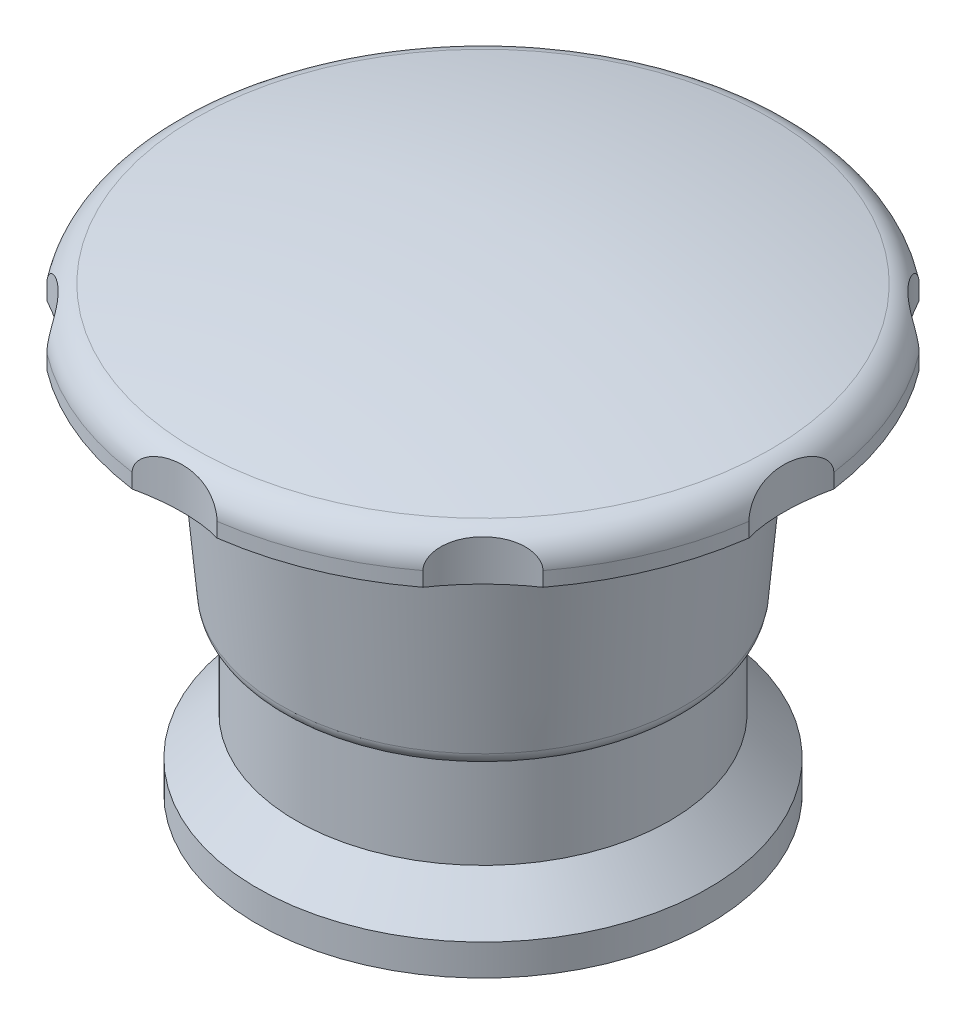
ISO-10303-21;
HEADER;
FILE_DESCRIPTION(('STEP AP214'),'2;1');
FILE_NAME('part.step','',(''),(''),'','','');
FILE_SCHEMA(('AUTOMOTIVE_DESIGN { 1 0 10303 214 1 1 1 1 }'));
ENDSEC;
DATA;
#1=APPLICATION_CONTEXT('core data for automotive mechanical design processes');
#2=APPLICATION_PROTOCOL_DEFINITION('international standard','automotive_design',2000,#1);
#3=PRODUCT_CONTEXT('',#1,'mechanical');
#4=PRODUCT('Part','Part','',(#3));
#5=PRODUCT_RELATED_PRODUCT_CATEGORY('part','',(#4));
#6=PRODUCT_DEFINITION_FORMATION('','',#4);
#7=PRODUCT_DEFINITION_CONTEXT('part definition',#1,'design');
#8=PRODUCT_DEFINITION('design','',#6,#7);
#9=PRODUCT_DEFINITION_SHAPE('','',#8);
#10=(LENGTH_UNIT() NAMED_UNIT(*) SI_UNIT(.MILLI.,.METRE.));
#11=(NAMED_UNIT(*) PLANE_ANGLE_UNIT() SI_UNIT($,.RADIAN.));
#12=(NAMED_UNIT(*) SI_UNIT($,.STERADIAN.) SOLID_ANGLE_UNIT());
#13=UNCERTAINTY_MEASURE_WITH_UNIT(LENGTH_MEASURE(1.E-05),#10,'distance_accuracy_value','');
#14=(GEOMETRIC_REPRESENTATION_CONTEXT(3) GLOBAL_UNCERTAINTY_ASSIGNED_CONTEXT((#13)) GLOBAL_UNIT_ASSIGNED_CONTEXT((#10,
#11,#12)) REPRESENTATION_CONTEXT('',''));
#15=CARTESIAN_POINT('',(0.,0.,0.));
#16=DIRECTION('',(0.,0.,1.));
#17=DIRECTION('',(1.,0.,0.));
#18=AXIS2_PLACEMENT_3D('',#15,#16,#17);
#19=CARTESIAN_POINT('',(0.,0.,0.));
#20=DIRECTION('',(0.,1.,0.));
#21=DIRECTION('',(-1.,0.,0.));
#22=AXIS2_PLACEMENT_3D('',#19,#20,#21);
#23=CYLINDRICAL_SURFACE('',#22,20.);
#24=DIRECTION('',(0.,-1.,0.));
#25=VECTOR('',#24,1.);
#26=CARTESIAN_POINT('',(-12.0819635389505,25.,15.9381980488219));
#27=LINE('',#26,#25);
#28=CARTESIAN_POINT('',(-12.0819635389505,25.5,15.9381980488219));
#29=VERTEX_POINT('',#28);
#30=CARTESIAN_POINT('',(-12.0819635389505,26.4287697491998,15.9381980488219));
#31=VERTEX_POINT('',#30);
#32=EDGE_CURVE('E57',#29,#31,#27,.F.);
#33=ORIENTED_EDGE('',*,*,#32,.F.);
#34=CARTESIAN_POINT('',(0.,25.5,0.));
#35=DIRECTION('',(0.,1.,0.));
#36=DIRECTION('',(-1.,0.,0.));
#37=AXIS2_PLACEMENT_3D('',#34,#35,#36);
#38=CIRCLE('',#37,20.);
#39=CARTESIAN_POINT('',(-2.72676957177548,25.5,19.8132462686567));
#40=VERTEX_POINT('',#39);
#41=EDGE_CURVE('E165',#29,#40,#38,.T.);
#42=ORIENTED_EDGE('',*,*,#41,.T.);
#43=DIRECTION('',(0.,-1.,0.));
#44=VECTOR('',#43,1.);
#45=CARTESIAN_POINT('',(-2.72676957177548,25.,19.8132462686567));
#46=LINE('',#45,#44);
#47=CARTESIAN_POINT('',(-2.72676957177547,26.4287697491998,19.8132462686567));
#48=VERTEX_POINT('',#47);
#49=EDGE_CURVE('E636',#48,#40,#46,.T.);
#50=ORIENTED_EDGE('',*,*,#49,.F.);
#51=CARTESIAN_POINT('',(0.,26.4287697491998,0.));
#52=DIRECTION('',(0.,1.,0.));
#53=DIRECTION('',(-1.,0.,0.));
#54=AXIS2_PLACEMENT_3D('',#51,#52,#53);
#55=CIRCLE('',#54,20.);
#56=EDGE_CURVE('E167',#31,#48,#55,.T.);
#57=ORIENTED_EDGE('',*,*,#56,.F.);
#58=EDGE_LOOP('',(#33,#42,#50,#57));
#59=FACE_BOUND('',#58,.T.);
#60=ADVANCED_FACE('F37',(#59),#23,.T.);
#61=DIRECTION('',(0.,-1.,0.));
#62=VECTOR('',#61,1.);
#63=CARTESIAN_POINT('',(-15.9381980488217,25.,12.0819635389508));
#64=LINE('',#63,#62);
#65=CARTESIAN_POINT('',(-15.9381980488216,26.4287697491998,12.0819635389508));
#66=VERTEX_POINT('',#65);
#67=CARTESIAN_POINT('',(-15.9381980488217,25.5,12.0819635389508));
#68=VERTEX_POINT('',#67);
#69=EDGE_CURVE('E156',#66,#68,#64,.T.);
#70=ORIENTED_EDGE('',*,*,#69,.F.);
#71=CARTESIAN_POINT('',(-19.8132462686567,26.4287697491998,2.72676957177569));
#72=VERTEX_POINT('',#71);
#73=EDGE_CURVE('E460',#72,#66,#55,.T.);
#74=ORIENTED_EDGE('',*,*,#73,.F.);
#75=DIRECTION('',(0.,-1.,0.));
#76=VECTOR('',#75,1.);
#77=CARTESIAN_POINT('',(-19.8132462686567,25.,2.72676957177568));
#78=LINE('',#77,#76);
#79=CARTESIAN_POINT('',(-19.8132462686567,25.5,2.72676957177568));
#80=VERTEX_POINT('',#79);
#81=EDGE_CURVE('E65',#80,#72,#78,.F.);
#82=ORIENTED_EDGE('',*,*,#81,.F.);
#83=EDGE_CURVE('E175',#80,#68,#38,.T.);
#84=ORIENTED_EDGE('',*,*,#83,.T.);
#85=EDGE_LOOP('',(#70,#74,#82,#84));
#86=FACE_BOUND('',#85,.T.);
#87=ADVANCED_FACE('F424',(#86),#23,.T.);
#88=DIRECTION('',(0.,-1.,0.));
#89=VECTOR('',#88,1.);
#90=CARTESIAN_POINT('',(-19.8132462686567,25.,-2.72676957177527));
#91=LINE('',#90,#89);
#92=CARTESIAN_POINT('',(-19.8132462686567,26.4287697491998,-2.72676957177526));
#93=VERTEX_POINT('',#92);
#94=CARTESIAN_POINT('',(-19.8132462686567,25.5,-2.72676957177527));
#95=VERTEX_POINT('',#94);
#96=EDGE_CURVE('E222',#93,#95,#91,.T.);
#97=ORIENTED_EDGE('',*,*,#96,.F.);
#98=CARTESIAN_POINT('',(-15.9381980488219,26.4287697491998,-12.0819635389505));
#99=VERTEX_POINT('',#98);
#100=EDGE_CURVE('E457',#99,#93,#55,.T.);
#101=ORIENTED_EDGE('',*,*,#100,.F.);
#102=DIRECTION('',(0.,-1.,0.));
#103=VECTOR('',#102,1.);
#104=CARTESIAN_POINT('',(-15.9381980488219,25.,-12.0819635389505));
#105=LINE('',#104,#103);
#106=CARTESIAN_POINT('',(-15.9381980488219,25.5,-12.0819635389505));
#107=VERTEX_POINT('',#106);
#108=EDGE_CURVE('E224',#107,#99,#105,.F.);
#109=ORIENTED_EDGE('',*,*,#108,.F.);
#110=EDGE_CURVE('E179',#107,#95,#38,.T.);
#111=ORIENTED_EDGE('',*,*,#110,.T.);
#112=EDGE_LOOP('',(#97,#101,#109,#111));
#113=FACE_BOUND('',#112,.T.);
#114=ADVANCED_FACE('F220',(#113),#23,.T.);
#115=DIRECTION('',(0.,-1.,0.));
#116=VECTOR('',#115,1.);
#117=CARTESIAN_POINT('',(-12.0819635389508,25.,-15.9381980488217));
#118=LINE('',#117,#116);
#119=CARTESIAN_POINT('',(-12.0819635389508,26.4287697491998,-15.9381980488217));
#120=VERTEX_POINT('',#119);
#121=CARTESIAN_POINT('',(-12.0819635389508,25.5,-15.9381980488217));
#122=VERTEX_POINT('',#121);
#123=EDGE_CURVE('E275',#120,#122,#118,.T.);
#124=ORIENTED_EDGE('',*,*,#123,.F.);
#125=CARTESIAN_POINT('',(-2.72676957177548,26.4287697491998,-19.8132462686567));
#126=VERTEX_POINT('',#125);
#127=EDGE_CURVE('E453',#126,#120,#55,.T.);
#128=ORIENTED_EDGE('',*,*,#127,.F.);
#129=DIRECTION('',(0.,-1.,0.));
#130=VECTOR('',#129,1.);
#131=CARTESIAN_POINT('',(-2.72676957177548,25.,-19.8132462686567));
#132=LINE('',#131,#130);
#133=CARTESIAN_POINT('',(-2.72676957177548,25.5,-19.8132462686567));
#134=VERTEX_POINT('',#133);
#135=EDGE_CURVE('E299',#134,#126,#132,.F.);
#136=ORIENTED_EDGE('',*,*,#135,.F.);
#137=EDGE_CURVE('E205',#134,#122,#38,.T.);
#138=ORIENTED_EDGE('',*,*,#137,.T.);
#139=EDGE_LOOP('',(#124,#128,#136,#138));
#140=FACE_BOUND('',#139,.T.);
#141=ADVANCED_FACE('F538',(#140),#23,.T.);
#142=DIRECTION('',(0.,-1.,0.));
#143=VECTOR('',#142,1.);
#144=CARTESIAN_POINT('',(2.72676957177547,25.,-19.8132462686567));
#145=LINE('',#144,#143);
#146=CARTESIAN_POINT('',(2.72676957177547,26.4287697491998,-19.8132462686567));
#147=VERTEX_POINT('',#146);
#148=CARTESIAN_POINT('',(2.72676957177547,25.5,-19.8132462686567));
#149=VERTEX_POINT('',#148);
#150=EDGE_CURVE('E298',#147,#149,#145,.T.);
#151=ORIENTED_EDGE('',*,*,#150,.F.);
#152=CARTESIAN_POINT('',(12.0819635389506,26.4287697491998,-15.9381980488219));
#153=VERTEX_POINT('',#152);
#154=EDGE_CURVE('E450',#153,#147,#55,.T.);
#155=ORIENTED_EDGE('',*,*,#154,.F.);
#156=DIRECTION('',(0.,-1.,0.));
#157=VECTOR('',#156,1.);
#158=CARTESIAN_POINT('',(12.0819635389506,25.,-15.9381980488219));
#159=LINE('',#158,#157);
#160=CARTESIAN_POINT('',(12.0819635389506,25.5,-15.9381980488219));
#161=VERTEX_POINT('',#160);
#162=EDGE_CURVE('E323',#161,#153,#159,.F.);
#163=ORIENTED_EDGE('',*,*,#162,.F.);
#164=EDGE_CURVE('E199',#161,#149,#38,.T.);
#165=ORIENTED_EDGE('',*,*,#164,.T.);
#166=EDGE_LOOP('',(#151,#155,#163,#165));
#167=FACE_BOUND('',#166,.T.);
#168=ADVANCED_FACE('F440',(#167),#23,.T.);
#169=DIRECTION('',(0.,-1.,0.));
#170=VECTOR('',#169,1.);
#171=CARTESIAN_POINT('',(15.9381980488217,25.,-12.0819635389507));
#172=LINE('',#171,#170);
#173=CARTESIAN_POINT('',(15.9381980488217,26.4287697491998,-12.0819635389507));
#174=VERTEX_POINT('',#173);
#175=CARTESIAN_POINT('',(15.9381980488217,25.5,-12.0819635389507));
#176=VERTEX_POINT('',#175);
#177=EDGE_CURVE('E322',#174,#176,#172,.T.);
#178=ORIENTED_EDGE('',*,*,#177,.F.);
#179=CARTESIAN_POINT('',(19.8132462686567,26.4287697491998,-2.72676957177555));
#180=VERTEX_POINT('',#179);
#181=EDGE_CURVE('E449',#180,#174,#55,.T.);
#182=ORIENTED_EDGE('',*,*,#181,.F.);
#183=DIRECTION('',(0.,-1.,0.));
#184=VECTOR('',#183,1.);
#185=CARTESIAN_POINT('',(19.8132462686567,25.,-2.72676957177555));
#186=LINE('',#185,#184);
#187=CARTESIAN_POINT('',(19.8132462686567,25.5,-2.72676957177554));
#188=VERTEX_POINT('',#187);
#189=EDGE_CURVE('E347',#188,#180,#186,.F.);
#190=ORIENTED_EDGE('',*,*,#189,.F.);
#191=EDGE_CURVE('E193',#188,#176,#38,.T.);
#192=ORIENTED_EDGE('',*,*,#191,.T.);
#193=EDGE_LOOP('',(#178,#182,#190,#192));
#194=FACE_BOUND('',#193,.T.);
#195=ADVANCED_FACE('F436',(#194),#23,.T.);
#196=DIRECTION('',(0.,-1.,0.));
#197=VECTOR('',#196,1.);
#198=CARTESIAN_POINT('',(19.8132462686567,25.,2.72676957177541));
#199=LINE('',#198,#197);
#200=CARTESIAN_POINT('',(19.8132462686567,26.4287697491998,2.7267695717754));
#201=VERTEX_POINT('',#200);
#202=CARTESIAN_POINT('',(19.8132462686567,25.5,2.72676957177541));
#203=VERTEX_POINT('',#202);
#204=EDGE_CURVE('E346',#201,#203,#199,.T.);
#205=ORIENTED_EDGE('',*,*,#204,.F.);
#206=CARTESIAN_POINT('',(15.9381980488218,26.4287697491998,12.0819635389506));
#207=VERTEX_POINT('',#206);
#208=EDGE_CURVE('E181',#207,#201,#55,.T.);
#209=ORIENTED_EDGE('',*,*,#208,.F.);
#210=DIRECTION('',(0.,-1.,0.));
#211=VECTOR('',#210,1.);
#212=CARTESIAN_POINT('',(15.9381980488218,25.,12.0819635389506));
#213=LINE('',#212,#211);
#214=CARTESIAN_POINT('',(15.9381980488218,25.5,12.0819635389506));
#215=VERTEX_POINT('',#214);
#216=EDGE_CURVE('E371',#215,#207,#213,.F.);
#217=ORIENTED_EDGE('',*,*,#216,.F.);
#218=EDGE_CURVE('E186',#215,#203,#38,.T.);
#219=ORIENTED_EDGE('',*,*,#218,.T.);
#220=EDGE_LOOP('',(#205,#209,#217,#219));
#221=FACE_BOUND('',#220,.T.);
#222=ADVANCED_FACE('F419',(#221),#23,.T.);
#223=CARTESIAN_POINT('',(0.,0.,0.));
#224=DIRECTION('',(0.,-1.,0.));
#225=DIRECTION('',(1.,0.,0.));
#226=AXIS2_PLACEMENT_3D('',#223,#224,#225);
#227=PLANE('',#226);
#228=CARTESIAN_POINT('',(0.,0.,0.));
#229=DIRECTION('',(0.,1.,0.));
#230=DIRECTION('',(-1.,0.,0.));
#231=AXIS2_PLACEMENT_3D('',#228,#229,#230);
#232=CIRCLE('',#231,14.5);
#233=CARTESIAN_POINT('',(-14.5,0.,0.));
#234=VERTEX_POINT('',#233);
#235=EDGE_CURVE('E50',#234,#234,#232,.T.);
#236=ORIENTED_EDGE('',*,*,#235,.F.);
#237=EDGE_LOOP('',(#236));
#238=FACE_BOUND('',#237,.T.);
#239=ADVANCED_FACE('F39',(#238),#227,.T.);
#240=CARTESIAN_POINT('',(0.,0.,0.));
#241=DIRECTION('',(0.,1.,0.));
#242=DIRECTION('',(-1.,0.,0.));
#243=AXIS2_PLACEMENT_3D('',#240,#241,#242);
#244=CYLINDRICAL_SURFACE('',#243,14.5);
#245=ORIENTED_EDGE('',*,*,#235,.T.);
#246=EDGE_LOOP('',(#245));
#247=FACE_BOUND('',#246,.T.);
#248=CARTESIAN_POINT('',(0.,2.,0.));
#249=DIRECTION('',(0.,1.,0.));
#250=DIRECTION('',(-1.,0.,0.));
#251=AXIS2_PLACEMENT_3D('',#248,#249,#250);
#252=CIRCLE('',#251,14.5);
#253=CARTESIAN_POINT('',(-14.5,2.,0.));
#254=VERTEX_POINT('',#253);
#255=EDGE_CURVE('E650',#254,#254,#252,.T.);
#256=ORIENTED_EDGE('',*,*,#255,.F.);
#257=EDGE_LOOP('',(#256));
#258=FACE_BOUND('',#257,.T.);
#259=ADVANCED_FACE('F412',(#247,#258),#244,.T.);
#260=CARTESIAN_POINT('',(0.,4.50000000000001,0.));
#261=DIRECTION('',(0.,-1.,0.));
#262=DIRECTION('',(1.,0.,0.));
#263=AXIS2_PLACEMENT_3D('',#260,#261,#262);
#264=CONICAL_SURFACE('',#263,12.,0.785398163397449);
#265=ORIENTED_EDGE('',*,*,#255,.T.);
#266=EDGE_LOOP('',(#265));
#267=FACE_BOUND('',#266,.T.);
#268=CARTESIAN_POINT('',(0.,4.50000000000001,0.));
#269=DIRECTION('',(0.,1.,0.));
#270=DIRECTION('',(-1.,0.,0.));
#271=AXIS2_PLACEMENT_3D('',#268,#269,#270);
#272=CIRCLE('',#271,12.);
#273=CARTESIAN_POINT('',(-12.,4.50000000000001,0.));
#274=VERTEX_POINT('',#273);
#275=EDGE_CURVE('E651',#274,#274,#272,.T.);
#276=ORIENTED_EDGE('',*,*,#275,.F.);
#277=EDGE_LOOP('',(#276));
#278=FACE_BOUND('',#277,.T.);
#279=ADVANCED_FACE('F409',(#267,#278),#264,.T.);
#280=CARTESIAN_POINT('',(0.,0.,0.));
#281=DIRECTION('',(0.,1.,0.));
#282=DIRECTION('',(-1.,0.,0.));
#283=AXIS2_PLACEMENT_3D('',#280,#281,#282);
#284=CYLINDRICAL_SURFACE('',#283,12.);
#285=ORIENTED_EDGE('',*,*,#275,.T.);
#286=EDGE_LOOP('',(#285));
#287=FACE_BOUND('',#286,.T.);
#288=CARTESIAN_POINT('',(0.,10.5,0.));
#289=DIRECTION('',(0.,1.,0.));
#290=DIRECTION('',(-1.,0.,0.));
#291=AXIS2_PLACEMENT_3D('',#288,#289,#290);
#292=CIRCLE('',#291,12.);
#293=CARTESIAN_POINT('',(-12.,10.5,0.));
#294=VERTEX_POINT('',#293);
#295=EDGE_CURVE('E654',#294,#294,#292,.T.);
#296=ORIENTED_EDGE('',*,*,#295,.F.);
#297=EDGE_LOOP('',(#296));
#298=FACE_BOUND('',#297,.T.);
#299=ADVANCED_FACE('F405',(#287,#298),#284,.T.);
#300=CARTESIAN_POINT('',(0.,11.5,0.));
#301=DIRECTION('',(0.,1.,0.));
#302=DIRECTION('',(-1.,0.,0.));
#303=AXIS2_PLACEMENT_3D('',#300,#301,#302);
#304=TOROIDAL_SURFACE('',#303,12.,1.);
#305=ORIENTED_EDGE('',*,*,#295,.T.);
#306=EDGE_LOOP('',(#305));
#307=FACE_BOUND('',#306,.T.);
#308=CARTESIAN_POINT('',(0.,11.4128442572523,0.));
#309=DIRECTION('',(0.,1.,0.));
#310=DIRECTION('',(-1.,0.,0.));
#311=AXIS2_PLACEMENT_3D('',#308,#309,#310);
#312=CIRCLE('',#311,12.9961946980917);
#313=CARTESIAN_POINT('',(-12.9961946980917,11.4128442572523,0.));
#314=VERTEX_POINT('',#313);
#315=EDGE_CURVE('E659',#314,#314,#312,.T.);
#316=ORIENTED_EDGE('',*,*,#315,.F.);
#317=EDGE_LOOP('',(#316));
#318=FACE_BOUND('',#317,.T.);
#319=ADVANCED_FACE('F401',(#307,#318),#304,.T.);
#320=CARTESIAN_POINT('',(0.,22.5213659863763,0.));
#321=DIRECTION('',(0.,1.,0.));
#322=DIRECTION('',(-1.,0.,0.));
#323=AXIS2_PLACEMENT_3D('',#320,#321,#322);
#324=CONICAL_SURFACE('',#323,13.9680644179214,0.0872664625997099);
#325=ORIENTED_EDGE('',*,*,#315,.T.);
#326=EDGE_LOOP('',(#325));
#327=FACE_BOUND('',#326,.T.);
#328=CARTESIAN_POINT('',(0.,22.5213659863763,0.));
#329=DIRECTION('',(0.,1.,0.));
#330=DIRECTION('',(-1.,0.,0.));
#331=AXIS2_PLACEMENT_3D('',#328,#329,#330);
#332=CIRCLE('',#331,13.9680644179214);
#333=CARTESIAN_POINT('',(-13.9680644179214,22.5213659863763,0.));
#334=VERTEX_POINT('',#333);
#335=EDGE_CURVE('E191',#334,#334,#332,.T.);
#336=ORIENTED_EDGE('',*,*,#335,.F.);
#337=EDGE_LOOP('',(#336));
#338=FACE_BOUND('',#337,.T.);
#339=ADVANCED_FACE('F397',(#327,#338),#324,.T.);
#340=CARTESIAN_POINT('',(0.,22.347054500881,0.));
#341=DIRECTION('',(0.,1.,0.));
#342=DIRECTION('',(-1.,0.,0.));
#343=AXIS2_PLACEMENT_3D('',#340,#341,#342);
#344=TOROIDAL_SURFACE('',#343,15.9604538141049,2.);
#345=ORIENTED_EDGE('',*,*,#335,.T.);
#346=EDGE_LOOP('',(#345));
#347=FACE_BOUND('',#346,.T.);
#348=CARTESIAN_POINT('',(0.,24.2789061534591,0.));
#349=DIRECTION('',(0.,1.,0.));
#350=DIRECTION('',(-1.,0.,0.));
#351=AXIS2_PLACEMENT_3D('',#348,#349,#350);
#352=CIRCLE('',#351,15.4428157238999);
#353=CARTESIAN_POINT('',(-15.4428157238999,24.2789061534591,0.));
#354=VERTEX_POINT('',#353);
#355=EDGE_CURVE('E185',#354,#354,#352,.T.);
#356=ORIENTED_EDGE('',*,*,#355,.F.);
#357=EDGE_LOOP('',(#356));
#358=FACE_BOUND('',#357,.T.);
#359=ADVANCED_FACE('F394',(#347,#358),#344,.F.);
#360=CARTESIAN_POINT('',(0.,25.5,0.));
#361=DIRECTION('',(0.,1.,0.));
#362=DIRECTION('',(-1.,0.,0.));
#363=AXIS2_PLACEMENT_3D('',#360,#361,#362);
#364=CONICAL_SURFACE('',#363,20.,1.30899693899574);
#365=CARTESIAN_POINT('',(-15.9396008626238,25.5002,12.0813484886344));
#366=CARTESIAN_POINT('',(-15.7583943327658,25.4743484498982,12.1607485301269));
#367=CARTESIAN_POINT('',(-15.5800473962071,25.4509102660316,12.2474937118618));
#368=CARTESIAN_POINT('',(-15.2302909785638,25.4092069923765,12.4351241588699));
#369=CARTESIAN_POINT('',(-15.0588825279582,25.3909426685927,12.5360115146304));
#370=CARTESIAN_POINT('',(-14.7242356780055,25.359937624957,12.7513780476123));
#371=CARTESIAN_POINT('',(-14.5609992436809,25.3471982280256,12.8658604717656));
#372=CARTESIAN_POINT('',(-14.243961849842,25.3274928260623,13.1076379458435));
#373=CARTESIAN_POINT('',(-14.0901599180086,25.3205262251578,13.2349316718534));
#374=CARTESIAN_POINT('',(-13.7928891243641,25.3124982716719,13.5016650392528));
#375=CARTESIAN_POINT('',(-13.6494361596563,25.3114458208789,13.6411226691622));
#376=CARTESIAN_POINT('',(-13.3741677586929,25.3152913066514,13.9310100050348));
#377=CARTESIAN_POINT('',(-13.2423523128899,25.3201892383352,14.0814397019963));
#378=CARTESIAN_POINT('',(-12.9914982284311,25.3358232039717,14.3918960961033));
#379=CARTESIAN_POINT('',(-12.8724388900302,25.346549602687,14.55190656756));
#380=CARTESIAN_POINT('',(-12.6476797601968,25.3736201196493,14.8805062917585));
#381=CARTESIAN_POINT('',(-12.5419738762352,25.3899616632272,15.0490915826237));
#382=CARTESIAN_POINT('',(-12.3763958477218,25.4218194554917,15.3380182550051));
#383=CARTESIAN_POINT('',(-12.3127413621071,25.4359000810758,15.456370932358));
#384=CARTESIAN_POINT('',(-12.1920682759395,25.4663568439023,15.6959131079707));
#385=CARTESIAN_POINT('',(-12.1350404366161,25.4827297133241,15.8170983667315));
#386=CARTESIAN_POINT('',(-12.0813484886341,25.5002,15.9396008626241));
#387=B_SPLINE_CURVE_WITH_KNOTS('',3,(#365,#366,#367,#368,#369,#370,#371,#372,#373,#374,#375,
#376,#377,#378,#379,#380,#381,#382,#383,#384,#385,#386),.UNSPECIFIED.,.F.,.F.,(4,2,2,2,2,2,2,2,
2,2,4),(0.,0.598413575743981,1.19691570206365,1.79556105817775,2.39414461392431,
2.99362889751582,3.59311268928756,4.19160845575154,4.78983016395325,5.19499253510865,
5.59958307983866),.UNSPECIFIED.);
#388=EDGE_CURVE('E153',#68,#29,#387,.T.);
#389=ORIENTED_EDGE('',*,*,#388,.F.);
#390=ORIENTED_EDGE('',*,*,#83,.F.);
#391=CARTESIAN_POINT('',(-19.8138033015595,25.5002,-2.72819641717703));
#392=CARTESIAN_POINT('',(-19.7418152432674,25.4743484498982,-2.54391974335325));
#393=CARTESIAN_POINT('',(-19.6770430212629,25.4509102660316,-2.35647130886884));
#394=CARTESIAN_POINT('',(-19.5624026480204,25.4092069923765,-1.97648141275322));
#395=CARTESIAN_POINT('',(-19.5125367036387,25.3909426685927,-1.78393920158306));
#396=CARTESIAN_POINT('',(-19.4281927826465,25.359937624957,-1.3950210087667));
#397=CARTESIAN_POINT('',(-19.3937184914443,25.3471982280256,-1.19864412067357));
#398=CARTESIAN_POINT('',(-19.3405016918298,25.3274928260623,-0.803502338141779));
#399=CARTESIAN_POINT('',(-19.321757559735,25.3205262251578,-0.60473769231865));
#400=CARTESIAN_POINT('',(-19.300164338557,25.3124982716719,-0.205926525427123));
#401=CARTESIAN_POINT('',(-19.297339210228,25.3114458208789,-0.00587852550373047));
#402=CARTESIAN_POINT('',(-19.307676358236,25.3152913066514,0.393746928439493));
#403=CARTESIAN_POINT('',(-19.3208386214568,25.3201892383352,0.593324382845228));
#404=CARTESIAN_POINT('',(-19.3629838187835,25.3358232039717,0.990230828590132));
#405=CARTESIAN_POINT('',(-19.3919406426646,25.346549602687,1.18756298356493));
#406=CARTESIAN_POINT('',(-19.4653670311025,25.3736201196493,1.57884678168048));
#407=CARTESIAN_POINT('',(-19.509829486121,25.3899616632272,1.77279993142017));
#408=CARTESIAN_POINT('',(-19.5970501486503,25.4218194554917,2.09418328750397));
#409=CARTESIAN_POINT('',(-19.635727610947,25.4359000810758,2.2228817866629));
#410=CARTESIAN_POINT('',(-19.7197807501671,25.4663568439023,2.47759244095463));
#411=CARTESIAN_POINT('',(-19.7651468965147,25.4827297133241,2.60360813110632));
#412=CARTESIAN_POINT('',(-19.8138033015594,25.5002,2.72819641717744));
#413=B_SPLINE_CURVE_WITH_KNOTS('',3,(#391,#392,#393,#394,#395,#396,#397,#398,#399,#400,#401,
#402,#403,#404,#405,#406,#407,#408,#409,#410,#411,#412),.UNSPECIFIED.,.F.,.F.,(4,2,2,2,2,2,2,2,
2,2,4),(0.,0.59841357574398,1.19691570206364,1.79556105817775,2.39414461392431,2.99362889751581,
3.59311268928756,4.19160845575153,4.78983016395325,5.19499253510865,5.59958307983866),.UNSPECIFIED.);
#414=EDGE_CURVE('E228',#95,#80,#413,.T.);
#415=ORIENTED_EDGE('',*,*,#414,.F.);
#416=ORIENTED_EDGE('',*,*,#110,.F.);
#417=CARTESIAN_POINT('',(-12.0813484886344,25.5002,-15.9396008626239));
#418=CARTESIAN_POINT('',(-12.1607485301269,25.4743484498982,-15.7583943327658));
#419=CARTESIAN_POINT('',(-12.2474937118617,25.4509102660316,-15.5800473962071));
#420=CARTESIAN_POINT('',(-12.4351241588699,25.4092069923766,-15.2302909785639));
#421=CARTESIAN_POINT('',(-12.5360115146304,25.3909426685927,-15.0588825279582));
#422=CARTESIAN_POINT('',(-12.7513780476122,25.359937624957,-14.7242356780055));
#423=CARTESIAN_POINT('',(-12.8658604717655,25.3471982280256,-14.5609992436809));
#424=CARTESIAN_POINT('',(-13.1076379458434,25.3274928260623,-14.2439618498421));
#425=CARTESIAN_POINT('',(-13.2349316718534,25.3205262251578,-14.0901599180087));
#426=CARTESIAN_POINT('',(-13.5016650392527,25.3124982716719,-13.7928891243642));
#427=CARTESIAN_POINT('',(-13.6411226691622,25.3114458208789,-13.6494361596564));
#428=CARTESIAN_POINT('',(-13.9310100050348,25.3152913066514,-13.3741677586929));
#429=CARTESIAN_POINT('',(-14.0814397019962,25.3201892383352,-13.2423523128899));
#430=CARTESIAN_POINT('',(-14.3918960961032,25.3358232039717,-12.9914982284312));
#431=CARTESIAN_POINT('',(-14.55190656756,25.346549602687,-12.8724388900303));
#432=CARTESIAN_POINT('',(-14.8805062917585,25.3736201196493,-12.6476797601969));
#433=CARTESIAN_POINT('',(-15.0490915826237,25.3899616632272,-12.5419738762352));
#434=CARTESIAN_POINT('',(-15.338018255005,25.4218194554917,-12.3763958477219));
#435=CARTESIAN_POINT('',(-15.4563709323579,25.4359000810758,-12.3127413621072));
#436=CARTESIAN_POINT('',(-15.6959131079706,25.4663568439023,-12.1920682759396));
#437=CARTESIAN_POINT('',(-15.8170983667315,25.4827297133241,-12.1350404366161));
#438=CARTESIAN_POINT('',(-15.9396008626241,25.5002,-12.0813484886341));
#439=B_SPLINE_CURVE_WITH_KNOTS('',3,(#417,#418,#419,#420,#421,#422,#423,#424,#425,#426,#427,
#428,#429,#430,#431,#432,#433,#434,#435,#436,#437,#438),.UNSPECIFIED.,.F.,.F.,(4,2,2,2,2,2,2,2,
2,2,4),(0.,0.598413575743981,1.19691570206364,1.79556105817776,2.39414461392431,
2.99362889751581,3.59311268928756,4.19160845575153,4.78983016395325,5.19499253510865,
5.59958307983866),.UNSPECIFIED.);
#440=EDGE_CURVE('E227',#122,#107,#439,.T.);
#441=ORIENTED_EDGE('',*,*,#440,.F.);
#442=ORIENTED_EDGE('',*,*,#137,.F.);
#443=CARTESIAN_POINT('',(2.72819641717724,25.5002,-19.8138033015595));
#444=CARTESIAN_POINT('',(2.54391974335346,25.4743484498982,-19.7418152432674));
#445=CARTESIAN_POINT('',(2.35647130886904,25.4509102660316,-19.6770430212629));
#446=CARTESIAN_POINT('',(1.97648141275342,25.4092069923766,-19.5624026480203));
#447=CARTESIAN_POINT('',(1.78393920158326,25.3909426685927,-19.5125367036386));
#448=CARTESIAN_POINT('',(1.3950210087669,25.359937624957,-19.4281927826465));
#449=CARTESIAN_POINT('',(1.19864412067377,25.3471982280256,-19.3937184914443));
#450=CARTESIAN_POINT('',(0.803502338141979,25.3274928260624,-19.3405016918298));
#451=CARTESIAN_POINT('',(0.604737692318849,25.3205262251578,-19.3217575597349));
#452=CARTESIAN_POINT('',(0.205926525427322,25.3124982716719,-19.300164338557));
#453=CARTESIAN_POINT('',(0.00587852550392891,25.3114458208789,-19.297339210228));
#454=CARTESIAN_POINT('',(-0.393746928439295,25.3152913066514,-19.307676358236));
#455=CARTESIAN_POINT('',(-0.593324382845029,25.3201892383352,-19.3208386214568));
#456=CARTESIAN_POINT('',(-0.990230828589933,25.3358232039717,-19.3629838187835));
#457=CARTESIAN_POINT('',(-1.18756298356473,25.346549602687,-19.3919406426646));
#458=CARTESIAN_POINT('',(-1.57884678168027,25.3736201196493,-19.4653670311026));
#459=CARTESIAN_POINT('',(-1.77279993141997,25.3899616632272,-19.509829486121));
#460=CARTESIAN_POINT('',(-2.09418328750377,25.4218194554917,-19.5970501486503));
#461=CARTESIAN_POINT('',(-2.2228817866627,25.4359000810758,-19.635727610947));
#462=CARTESIAN_POINT('',(-2.47759244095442,25.4663568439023,-19.7197807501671));
#463=CARTESIAN_POINT('',(-2.60360813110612,25.4827297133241,-19.7651468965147));
#464=CARTESIAN_POINT('',(-2.72819641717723,25.5002,-19.8138033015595));
#465=B_SPLINE_CURVE_WITH_KNOTS('',3,(#443,#444,#445,#446,#447,#448,#449,#450,#451,#452,#453,
#454,#455,#456,#457,#458,#459,#460,#461,#462,#463,#464),.UNSPECIFIED.,.F.,.F.,(4,2,2,2,2,2,2,2,
2,2,4),(0.,0.598413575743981,1.19691570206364,1.79556105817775,2.39414461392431,
2.99362889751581,3.59311268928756,4.19160845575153,4.78983016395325,5.19499253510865,
5.59958307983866),.UNSPECIFIED.);
#466=EDGE_CURVE('E287',#149,#134,#465,.T.);
#467=ORIENTED_EDGE('',*,*,#466,.F.);
#468=ORIENTED_EDGE('',*,*,#164,.F.);
#469=CARTESIAN_POINT('',(15.9396008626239,25.5002,-12.0813484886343));
#470=CARTESIAN_POINT('',(15.7583943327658,25.4743484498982,-12.1607485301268));
#471=CARTESIAN_POINT('',(15.5800473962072,25.4509102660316,-12.2474937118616));
#472=CARTESIAN_POINT('',(15.2302909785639,25.4092069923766,-12.4351241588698));
#473=CARTESIAN_POINT('',(15.0588825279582,25.3909426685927,-12.5360115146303));
#474=CARTESIAN_POINT('',(14.7242356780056,25.359937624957,-12.7513780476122));
#475=CARTESIAN_POINT('',(14.5609992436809,25.3471982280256,-12.8658604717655));
#476=CARTESIAN_POINT('',(14.2439618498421,25.3274928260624,-13.1076379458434));
#477=CARTESIAN_POINT('',(14.0901599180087,25.3205262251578,-13.2349316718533));
#478=CARTESIAN_POINT('',(13.7928891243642,25.3124982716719,-13.5016650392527));
#479=CARTESIAN_POINT('',(13.6494361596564,25.3114458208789,-13.6411226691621));
#480=CARTESIAN_POINT('',(13.374167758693,25.3152913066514,-13.9310100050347));
#481=CARTESIAN_POINT('',(13.24235231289,25.3201892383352,-14.0814397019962));
#482=CARTESIAN_POINT('',(12.9914982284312,25.3358232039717,-14.3918960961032));
#483=CARTESIAN_POINT('',(12.8724388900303,25.346549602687,-14.5519065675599));
#484=CARTESIAN_POINT('',(12.6476797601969,25.3736201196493,-14.8805062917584));
#485=CARTESIAN_POINT('',(12.5419738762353,25.3899616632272,-15.0490915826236));
#486=CARTESIAN_POINT('',(12.3763958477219,25.4218194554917,-15.338018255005));
#487=CARTESIAN_POINT('',(12.3127413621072,25.4359000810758,-15.4563709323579));
#488=CARTESIAN_POINT('',(12.1920682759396,25.4663568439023,-15.6959131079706));
#489=CARTESIAN_POINT('',(12.1350404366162,25.4827297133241,-15.8170983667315));
#490=CARTESIAN_POINT('',(12.0813484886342,25.5002,-15.939600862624));
#491=B_SPLINE_CURVE_WITH_KNOTS('',3,(#469,#470,#471,#472,#473,#474,#475,#476,#477,#478,#479,
#480,#481,#482,#483,#484,#485,#486,#487,#488,#489,#490),.UNSPECIFIED.,.F.,.F.,(4,2,2,2,2,2,2,2,
2,2,4),(0.,0.598413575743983,1.19691570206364,1.79556105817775,2.39414461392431,
2.99362889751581,3.59311268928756,4.19160845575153,4.78983016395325,5.19499253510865,
5.59958307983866),.UNSPECIFIED.);
#492=EDGE_CURVE('E311',#176,#161,#491,.T.);
#493=ORIENTED_EDGE('',*,*,#492,.F.);
#494=ORIENTED_EDGE('',*,*,#191,.F.);
#495=CARTESIAN_POINT('',(19.8138033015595,25.5002,2.72819641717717));
#496=CARTESIAN_POINT('',(19.7418152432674,25.4743484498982,2.54391974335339));
#497=CARTESIAN_POINT('',(19.6770430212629,25.4509102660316,2.35647130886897));
#498=CARTESIAN_POINT('',(19.5624026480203,25.4092069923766,1.97648141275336));
#499=CARTESIAN_POINT('',(19.5125367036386,25.3909426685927,1.78393920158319));
#500=CARTESIAN_POINT('',(19.4281927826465,25.359937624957,1.39502100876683));
#501=CARTESIAN_POINT('',(19.3937184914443,25.3471982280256,1.1986441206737));
#502=CARTESIAN_POINT('',(19.3405016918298,25.3274928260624,0.803502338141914));
#503=CARTESIAN_POINT('',(19.3217575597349,25.3205262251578,0.604737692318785));
#504=CARTESIAN_POINT('',(19.300164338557,25.3124982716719,0.205926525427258));
#505=CARTESIAN_POINT('',(19.297339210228,25.3114458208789,0.0058785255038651));
#506=CARTESIAN_POINT('',(19.307676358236,25.3152913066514,-0.393746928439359));
#507=CARTESIAN_POINT('',(19.3208386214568,25.3201892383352,-0.593324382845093));
#508=CARTESIAN_POINT('',(19.3629838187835,25.3358232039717,-0.990230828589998));
#509=CARTESIAN_POINT('',(19.3919406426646,25.346549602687,-1.1875629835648));
#510=CARTESIAN_POINT('',(19.4653670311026,25.3736201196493,-1.57884678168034));
#511=CARTESIAN_POINT('',(19.509829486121,25.3899616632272,-1.77279993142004));
#512=CARTESIAN_POINT('',(19.5970501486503,25.4218194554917,-2.09418328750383));
#513=CARTESIAN_POINT('',(19.635727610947,25.4359000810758,-2.22288178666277));
#514=CARTESIAN_POINT('',(19.7197807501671,25.4663568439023,-2.47759244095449));
#515=CARTESIAN_POINT('',(19.7651468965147,25.4827297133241,-2.60360813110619));
#516=CARTESIAN_POINT('',(19.8138033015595,25.5002,-2.7281964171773));
#517=B_SPLINE_CURVE_WITH_KNOTS('',3,(#495,#496,#497,#498,#499,#500,#501,#502,#503,#504,#505,
#506,#507,#508,#509,#510,#511,#512,#513,#514,#515,#516),.UNSPECIFIED.,.F.,.F.,(4,2,2,2,2,2,2,2,
2,2,4),(0.,0.598413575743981,1.19691570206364,1.79556105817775,2.39414461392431,
2.99362889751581,3.59311268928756,4.19160845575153,4.78983016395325,5.19499253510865,
5.59958307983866),.UNSPECIFIED.);
#518=EDGE_CURVE('E335',#203,#188,#517,.T.);
#519=ORIENTED_EDGE('',*,*,#518,.F.);
#520=ORIENTED_EDGE('',*,*,#218,.F.);
#521=CARTESIAN_POINT('',(12.0813484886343,25.5002,15.939600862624));
#522=CARTESIAN_POINT('',(12.1607485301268,25.4743484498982,15.7583943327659));
#523=CARTESIAN_POINT('',(12.2474937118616,25.4509102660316,15.5800473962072));
#524=CARTESIAN_POINT('',(12.4351241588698,25.4092069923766,15.2302909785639));
#525=CARTESIAN_POINT('',(12.5360115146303,25.3909426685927,15.0588825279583));
#526=CARTESIAN_POINT('',(12.7513780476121,25.359937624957,14.7242356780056));
#527=CARTESIAN_POINT('',(12.8658604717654,25.3471982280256,14.560999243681));
#528=CARTESIAN_POINT('',(13.1076379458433,25.3274928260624,14.2439618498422));
#529=CARTESIAN_POINT('',(13.2349316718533,25.3205262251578,14.0901599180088));
#530=CARTESIAN_POINT('',(13.5016650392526,25.3124982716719,13.7928891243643));
#531=CARTESIAN_POINT('',(13.6411226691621,25.3114458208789,13.6494361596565));
#532=CARTESIAN_POINT('',(13.9310100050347,25.3152913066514,13.374167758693));
#533=CARTESIAN_POINT('',(14.0814397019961,25.3201892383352,13.24235231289));
#534=CARTESIAN_POINT('',(14.3918960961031,25.3358232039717,12.9914982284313));
#535=CARTESIAN_POINT('',(14.5519065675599,25.346549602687,12.8724388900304));
#536=CARTESIAN_POINT('',(14.8805062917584,25.3736201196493,12.647679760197));
#537=CARTESIAN_POINT('',(15.0490915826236,25.3899616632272,12.5419738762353));
#538=CARTESIAN_POINT('',(15.3380182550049,25.4218194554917,12.376395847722));
#539=CARTESIAN_POINT('',(15.4563709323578,25.4359000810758,12.3127413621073));
#540=CARTESIAN_POINT('',(15.6959131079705,25.4663568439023,12.1920682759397));
#541=CARTESIAN_POINT('',(15.8170983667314,25.4827297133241,12.1350404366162));
#542=CARTESIAN_POINT('',(15.939600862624,25.5002,12.0813484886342));
#543=B_SPLINE_CURVE_WITH_KNOTS('',3,(#521,#522,#523,#524,#525,#526,#527,#528,#529,#530,#531,
#532,#533,#534,#535,#536,#537,#538,#539,#540,#541,#542),.UNSPECIFIED.,.F.,.F.,(4,2,2,2,2,2,2,2,
2,2,4),(0.,0.59841357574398,1.19691570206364,1.79556105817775,2.39414461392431,2.99362889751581,
3.59311268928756,4.19160845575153,4.78983016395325,5.19499253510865,5.59958307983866),.UNSPECIFIED.);
#544=CARTESIAN_POINT('',(12.0819635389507,25.5,15.9381980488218));
#545=VERTEX_POINT('',#544);
#546=EDGE_CURVE('E359',#545,#215,#543,.T.);
#547=ORIENTED_EDGE('',*,*,#546,.F.);
#548=CARTESIAN_POINT('',(2.72676957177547,25.5,19.8132462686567));
#549=VERTEX_POINT('',#548);
#550=EDGE_CURVE('E178',#549,#545,#38,.T.);
#551=ORIENTED_EDGE('',*,*,#550,.F.);
#552=CARTESIAN_POINT('',(-2.72819641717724,25.5002,19.8138033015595));
#553=CARTESIAN_POINT('',(-2.54391974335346,25.4743484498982,19.7418152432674));
#554=CARTESIAN_POINT('',(-2.35647130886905,25.4509102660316,19.6770430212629));
#555=CARTESIAN_POINT('',(-1.97648141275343,25.4092069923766,19.5624026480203));
#556=CARTESIAN_POINT('',(-1.78393920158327,25.3909426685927,19.5125367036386));
#557=CARTESIAN_POINT('',(-1.3950210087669,25.359937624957,19.4281927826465));
#558=CARTESIAN_POINT('',(-1.19864412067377,25.3471982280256,19.3937184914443));
#559=CARTESIAN_POINT('',(-0.803502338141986,25.3274928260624,19.3405016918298));
#560=CARTESIAN_POINT('',(-0.604737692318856,25.3205262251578,19.3217575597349));
#561=CARTESIAN_POINT('',(-0.205926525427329,25.3124982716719,19.300164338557));
#562=CARTESIAN_POINT('',(-0.00587852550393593,25.3114458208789,19.297339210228));
#563=CARTESIAN_POINT('',(0.393746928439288,25.3152913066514,19.307676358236));
#564=CARTESIAN_POINT('',(0.593324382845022,25.3201892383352,19.3208386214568));
#565=CARTESIAN_POINT('',(0.990230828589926,25.3358232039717,19.3629838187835));
#566=CARTESIAN_POINT('',(1.18756298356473,25.346549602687,19.3919406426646));
#567=CARTESIAN_POINT('',(1.57884678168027,25.3736201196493,19.4653670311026));
#568=CARTESIAN_POINT('',(1.77279993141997,25.3899616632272,19.509829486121));
#569=CARTESIAN_POINT('',(2.09418328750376,25.4218194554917,19.5970501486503));
#570=CARTESIAN_POINT('',(2.22288178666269,25.4359000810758,19.635727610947));
#571=CARTESIAN_POINT('',(2.47759244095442,25.4663568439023,19.7197807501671));
#572=CARTESIAN_POINT('',(2.60360813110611,25.4827297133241,19.7651468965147));
#573=CARTESIAN_POINT('',(2.72819641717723,25.5002,19.8138033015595));
#574=B_SPLINE_CURVE_WITH_KNOTS('',3,(#552,#553,#554,#555,#556,#557,#558,#559,#560,#561,#562,
#563,#564,#565,#566,#567,#568,#569,#570,#571,#572,#573),.UNSPECIFIED.,.F.,.F.,(4,2,2,2,2,2,2,2,
2,2,4),(0.,0.598413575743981,1.19691570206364,1.79556105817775,2.39414461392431,
2.99362889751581,3.59311268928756,4.19160845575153,4.78983016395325,5.19499253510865,
5.59958307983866),.UNSPECIFIED.);
#575=EDGE_CURVE('E174',#40,#549,#574,.T.);
#576=ORIENTED_EDGE('',*,*,#575,.F.);
#577=ORIENTED_EDGE('',*,*,#41,.F.);
#578=EDGE_LOOP('',(#389,#390,#415,#416,#441,#442,#467,#468,#493,#494,#519,#520,#547,#551,#576,#577));
#579=FACE_BOUND('',#578,.T.);
#580=ORIENTED_EDGE('',*,*,#355,.T.);
#581=EDGE_LOOP('',(#580));
#582=FACE_BOUND('',#581,.T.);
#583=ADVANCED_FACE('F171',(#579,#582),#364,.T.);
#584=DIRECTION('',(0.,-1.,0.));
#585=VECTOR('',#584,1.);
#586=CARTESIAN_POINT('',(12.0819635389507,25.,15.9381980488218));
#587=LINE('',#586,#585);
#588=CARTESIAN_POINT('',(12.0819635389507,26.4287697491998,15.9381980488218));
#589=VERTEX_POINT('',#588);
#590=EDGE_CURVE('E370',#589,#545,#587,.T.);
#591=ORIENTED_EDGE('',*,*,#590,.F.);
#592=CARTESIAN_POINT('',(2.72676957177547,26.4287697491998,19.8132462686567));
#593=VERTEX_POINT('',#592);
#594=EDGE_CURVE('E176',#593,#589,#55,.T.);
#595=ORIENTED_EDGE('',*,*,#594,.F.);
#596=DIRECTION('',(0.,-1.,0.));
#597=VECTOR('',#596,1.);
#598=CARTESIAN_POINT('',(2.72676957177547,25.,19.8132462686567));
#599=LINE('',#598,#597);
#600=EDGE_CURVE('E388',#549,#593,#599,.F.);
#601=ORIENTED_EDGE('',*,*,#600,.F.);
#602=ORIENTED_EDGE('',*,*,#550,.T.);
#603=EDGE_LOOP('',(#591,#595,#601,#602));
#604=FACE_BOUND('',#603,.T.);
#605=ADVANCED_FACE('F393',(#604),#23,.T.);
#606=CARTESIAN_POINT('',(0.,26.4287697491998,0.));
#607=DIRECTION('',(0.,1.,0.));
#608=DIRECTION('',(-1.,0.,0.));
#609=AXIS2_PLACEMENT_3D('',#606,#607,#608);
#610=TOROIDAL_SURFACE('',#609,18.,1.99999999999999);
#611=CARTESIAN_POINT('',(-12.0819635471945,26.4285697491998,15.9381980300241));
#612=CARTESIAN_POINT('',(-12.0819606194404,26.4571402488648,15.938207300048));
#613=CARTESIAN_POINT('',(-12.0824638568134,26.4856960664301,15.9370569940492));
#614=CARTESIAN_POINT('',(-12.0844719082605,26.5425743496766,15.932483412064));
#615=CARTESIAN_POINT('',(-12.0859761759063,26.5708969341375,15.9290613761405));
#616=CARTESIAN_POINT('',(-12.0919455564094,26.654838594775,15.9155222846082));
#617=CARTESIAN_POINT('',(-12.0978676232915,26.7098610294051,15.9021307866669));
#618=CARTESIAN_POINT('',(-12.1133575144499,26.8166709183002,15.8675481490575));
#619=CARTESIAN_POINT('',(-12.1229186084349,26.8684641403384,15.8463714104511));
#620=CARTESIAN_POINT('',(-12.1453733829,26.9681313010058,15.7974473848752));
#621=CARTESIAN_POINT('',(-12.1582726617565,27.0159984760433,15.7696890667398));
#622=CARTESIAN_POINT('',(-12.193781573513,27.1285915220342,15.6947467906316));
#623=CARTESIAN_POINT('',(-12.2181138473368,27.1907641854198,15.644541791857));
#624=CARTESIAN_POINT('',(-12.27219740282,27.3054322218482,15.5365989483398));
#625=CARTESIAN_POINT('',(-12.3019601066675,27.3579067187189,15.4788453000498));
#626=CARTESIAN_POINT('',(-12.3826105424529,27.4786427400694,15.327771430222));
#627=CARTESIAN_POINT('',(-12.4364838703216,27.5411171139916,15.2314520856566));
#628=CARTESIAN_POINT('',(-12.5527881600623,27.6492776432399,15.0347312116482));
#629=CARTESIAN_POINT('',(-12.6152380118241,27.6949258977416,14.9343210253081));
#630=CARTESIAN_POINT('',(-12.7365037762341,27.7664103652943,14.7496433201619));
#631=CARTESIAN_POINT('',(-12.7942404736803,27.7942667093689,14.6654245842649));
#632=CARTESIAN_POINT('',(-12.914255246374,27.8421686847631,14.4979531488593));
#633=CARTESIAN_POINT('',(-12.9765364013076,27.8622089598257,14.4147011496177));
#634=CARTESIAN_POINT('',(-13.1053135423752,27.8956608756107,14.2499080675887));
#635=CARTESIAN_POINT('',(-13.1718175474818,27.9090594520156,14.1683706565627));
#636=CARTESIAN_POINT('',(-13.3085733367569,27.9299642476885,14.0077682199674));
#637=CARTESIAN_POINT('',(-13.3788242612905,27.9374718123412,13.9287026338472));
#638=CARTESIAN_POINT('',(-13.5275558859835,27.9473710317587,13.7682967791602));
#639=CARTESIAN_POINT('',(-13.606273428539,27.9493905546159,13.6871531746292));
#640=CARTESIAN_POINT('',(-13.7672756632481,27.9473923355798,13.528528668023));
#641=CARTESIAN_POINT('',(-13.8495611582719,27.9433732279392,13.451048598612));
#642=CARTESIAN_POINT('',(-14.0170947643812,27.9290325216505,13.3002795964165));
#643=CARTESIAN_POINT('',(-14.1023369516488,27.9187229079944,13.2269829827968));
#644=CARTESIAN_POINT('',(-14.2753006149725,27.8911172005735,13.0848496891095));
#645=CARTESIAN_POINT('',(-14.3630209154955,27.8738243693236,13.0160109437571));
#646=CARTESIAN_POINT('',(-14.5589370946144,27.826584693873,12.8691436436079));
#647=CARTESIAN_POINT('',(-14.6675501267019,27.7947384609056,12.7922381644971));
#648=CARTESIAN_POINT('',(-14.830500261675,27.7357447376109,12.6830686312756));
#649=CARTESIAN_POINT('',(-14.884821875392,27.714209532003,12.6477103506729));
#650=CARTESIAN_POINT('',(-14.993009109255,27.6668873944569,12.5792245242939));
#651=CARTESIAN_POINT('',(-15.0468748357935,27.6411014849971,12.5460964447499));
#652=CARTESIAN_POINT('',(-15.1815013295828,27.5699661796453,12.4655657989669));
#653=CARTESIAN_POINT('',(-15.2615908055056,27.521439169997,12.4197616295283));
#654=CARTESIAN_POINT('',(-15.4160643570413,27.4111343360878,12.3348925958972));
#655=CARTESIAN_POINT('',(-15.4904592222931,27.3493824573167,12.295814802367));
#656=CARTESIAN_POINT('',(-15.6070315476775,27.2324959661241,12.2367185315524));
#657=CARTESIAN_POINT('',(-15.6520306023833,27.1812816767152,12.2145531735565));
#658=CARTESIAN_POINT('',(-15.7346733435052,27.0716209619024,12.1747107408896));
#659=CARTESIAN_POINT('',(-15.7723252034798,27.0131826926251,12.1570286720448));
#660=CARTESIAN_POINT('',(-15.832226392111,26.9000150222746,12.1293535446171));
#661=CARTESIAN_POINT('',(-15.8559963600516,26.8462876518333,12.1185705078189));
#662=CARTESIAN_POINT('',(-15.8950901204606,26.7352532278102,12.1009968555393));
#663=CARTESIAN_POINT('',(-15.9104296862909,26.6779530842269,12.0941987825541));
#664=CARTESIAN_POINT('',(-15.9266898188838,26.5882185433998,12.0870194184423));
#665=CARTESIAN_POINT('',(-15.9309974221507,26.5564845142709,12.0851248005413));
#666=CARTESIAN_POINT('',(-15.9367586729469,26.4926968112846,12.0825946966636));
#667=CARTESIAN_POINT('',(-15.9382111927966,26.4606430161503,12.0819597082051));
#668=CARTESIAN_POINT('',(-15.9381980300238,26.4285697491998,12.0819635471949));
#669=B_SPLINE_CURVE_WITH_KNOTS('',3,(#611,#612,#613,#614,#615,#616,#617,#618,#619,#620,#621,
#622,#623,#624,#625,#626,#627,#628,#629,#630,#631,#632,#633,#634,#635,#636,#637,#638,#639,#640,
#641,#642,#643,#644,#645,#646,#647,#648,#649,#650,#651,#652,#653,#654,#655,#656,#657,#658,#659,
#660,#661,#662,#663,#664,#665,#666,#667,#668),.UNSPECIFIED.,.F.,.F.,(4,2,2,2,2,2,2,2,2,2,2,2,2,
2,2,2,2,2,2,2,2,2,2,2,2,2,2,2,4),(0.,0.0856550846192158,0.171263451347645,0.341209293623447,
0.510842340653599,0.680761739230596,0.929953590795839,1.1796757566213,1.55800432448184,
1.93717994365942,2.25427145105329,2.57157987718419,2.88951000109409,3.20736749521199,
3.54629614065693,3.88530145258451,4.22366288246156,4.56186641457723,4.97138584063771,
5.17614407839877,5.3808531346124,5.69264976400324,6.00384020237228,6.21819572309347,
6.43231140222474,6.61078338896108,6.78892030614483,6.88502541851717,6.98116848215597),.UNSPECIFIED.);
#670=EDGE_CURVE('E168',#31,#66,#669,.T.);
#671=ORIENTED_EDGE('',*,*,#670,.F.);
#672=ORIENTED_EDGE('',*,*,#56,.T.);
#673=CARTESIAN_POINT('',(2.72676955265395,26.4285697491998,19.813246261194));
#674=CARTESIAN_POINT('',(2.7267781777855,26.4571402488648,19.8132507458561));
#675=CARTESIAN_POINT('',(2.72560894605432,26.4856960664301,19.8127931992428));
#676=CARTESIAN_POINT('',(2.72095502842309,26.5425743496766,19.810979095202));
#677=CARTESIAN_POINT('',(2.71747160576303,26.5708969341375,19.8096230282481));
#678=CARTESIAN_POINT('',(2.7036770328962,26.654838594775,19.8042704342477));
#679=CARTESIAN_POINT('',(2.69002028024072,26.7098610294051,19.7989887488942));
#680=CARTESIAN_POINT('',(2.65461365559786,26.8166709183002,19.7854881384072));
#681=CARTESIAN_POINT('',(2.63287872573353,26.8684641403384,19.7772746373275));
#682=CARTESIAN_POINT('',(2.58240629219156,26.9681313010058,19.7585580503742));
#683=CARTESIAN_POINT('',(2.55365702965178,27.0159984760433,19.7480511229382));
#684=CARTESIAN_POINT('',(2.47555624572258,27.1285915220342,19.7201675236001));
#685=CARTESIAN_POINT('',(2.4228504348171,27.1907641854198,19.7018727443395));
#686=CARTESIAN_POINT('',(2.30828046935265,27.3054322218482,19.6637884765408));
#687=CARTESIAN_POINT('',(2.24639706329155,27.3579067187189,19.6439958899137));
#688=CARTESIAN_POINT('',(2.08254323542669,27.4786427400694,19.5941990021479));
#689=CARTESIAN_POINT('',(1.97634097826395,27.5411171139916,19.5641851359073));
#690=CARTESIAN_POINT('',(1.75499876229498,27.6492776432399,19.5073220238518));
#691=CARTESIAN_POINT('',(1.63983932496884,27.6949258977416,19.4804800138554));
#692=CARTESIAN_POINT('',(1.42350462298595,27.7664103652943,19.4356410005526));
#693=CARTESIAN_POINT('',(1.32312697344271,27.7942667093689,19.4169153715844));
#694=CARTESIAN_POINT('',(1.11984352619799,27.8421686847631,19.3833584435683));
#695=CARTESIAN_POINT('',(1.01693604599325,27.8622089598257,19.3685298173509));
#696=CARTESIAN_POINT('',(0.809350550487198,27.8956608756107,19.3430627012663));
#697=CARTESIAN_POINT('',(0.704669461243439,27.9090594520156,19.3324324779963));
#698=CARTESIAN_POINT('',(0.494405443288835,27.9299642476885,19.3155703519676));
#699=CARTESIAN_POINT('',(0.388822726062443,27.9374718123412,19.3093374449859));
#700=CARTESIAN_POINT('',(0.170229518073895,27.9473710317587,19.301082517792));
#701=CARTESIAN_POINT('',(0.057190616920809,27.9493905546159,19.2993670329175));
#702=CARTESIAN_POINT('',(-0.168819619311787,27.9473923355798,19.301048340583));
#703=CARTESIAN_POINT('',(-0.281790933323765,27.9433732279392,19.3044462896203));
#704=CARTESIAN_POINT('',(-0.506864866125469,27.9290325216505,19.3163006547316));
#705=CARTESIAN_POINT('',(-0.618968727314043,27.9187229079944,19.3247474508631));
#706=CARTESIAN_POINT('',(-0.841775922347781,27.8911172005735,19.3465478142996));
#707=CARTESIAN_POINT('',(-0.952479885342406,27.8738243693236,19.35989909));
#708=CARTESIAN_POINT('',(-1.19486440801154,27.826584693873,19.3945818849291));
#709=CARTESIAN_POINT('',(-1.32604580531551,27.7947384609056,19.4170025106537));
#710=CARTESIAN_POINT('',(-1.51846346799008,27.7357447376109,19.4550311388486));
#711=CARTESIAN_POINT('',(-1.5818767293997,27.714209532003,19.4684402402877));
#712=CARTESIAN_POINT('',(-1.70680344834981,27.6668873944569,19.4965133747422));
#713=CARTESIAN_POINT('',(-1.7683173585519,27.6411014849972,19.5111771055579));
#714=CARTESIAN_POINT('',(-1.92045643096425,27.5699661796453,19.5494286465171));
#715=CARTESIAN_POINT('',(-2.00947668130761,27.521439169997,19.5736720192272));
#716=CARTESIAN_POINT('',(-2.17871744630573,27.4111343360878,19.6228898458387));
#717=CARTESIAN_POINT('',(-2.25895473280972,27.3493824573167,19.6478627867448));
#718=CARTESIAN_POINT('',(-2.38317118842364,27.2324959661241,19.6885044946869));
#719=CARTESIAN_POINT('',(-2.43066360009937,27.1812816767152,19.70465035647));
#720=CARTESIAN_POINT('',(-2.51727369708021,27.0716209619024,19.7349147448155));
#721=CARTESIAN_POINT('',(-2.55640069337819,27.0131826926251,19.7490355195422));
#722=CARTESIAN_POINT('',(-2.61832650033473,26.9000150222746,19.7718227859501));
#723=CARTESIAN_POINT('',(-2.64275916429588,26.8462876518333,19.7810059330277));
#724=CARTESIAN_POINT('',(-2.6828290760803,26.7352532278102,19.7962229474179));
#725=CARTESIAN_POINT('',(-2.69848275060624,26.6779530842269,19.8022626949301));
#726=CARTESIAN_POINT('',(-2.71505697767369,26.5882185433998,19.8086837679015));
#727=CARTESIAN_POINT('',(-2.7194426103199,26.5564845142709,19.8103900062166));
#728=CARTESIAN_POINT('',(-2.72530548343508,26.4926968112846,19.8126747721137));
#729=CARTESIAN_POINT('',(-2.72678157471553,26.4606430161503,19.8132528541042));
#730=CARTESIAN_POINT('',(-2.72676955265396,26.4285697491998,19.813246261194));
#731=B_SPLINE_CURVE_WITH_KNOTS('',3,(#673,#674,#675,#676,#677,#678,#679,#680,#681,#682,#683,
#684,#685,#686,#687,#688,#689,#690,#691,#692,#693,#694,#695,#696,#697,#698,#699,#700,#701,#702,
#703,#704,#705,#706,#707,#708,#709,#710,#711,#712,#713,#714,#715,#716,#717,#718,#719,#720,#721,
#722,#723,#724,#725,#726,#727,#728,#729,#730),.UNSPECIFIED.,.F.,.F.,(4,2,2,2,2,2,2,2,2,2,2,2,2,
2,2,2,2,2,2,2,2,2,2,2,2,2,2,2,4),(0.,0.0856550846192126,0.171263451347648,0.341209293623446,
0.510842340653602,0.680761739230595,0.929953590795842,1.1796757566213,1.55800432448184,
1.93717994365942,2.25427145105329,2.57157987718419,2.88951000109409,3.20736749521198,
3.54629614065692,3.88530145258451,4.22366288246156,4.56186641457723,4.9713858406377,
5.17614407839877,5.3808531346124,5.69264976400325,6.00384020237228,6.21819572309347,
6.43231140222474,6.61078338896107,6.78892030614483,6.88502541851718,6.98116848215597),.UNSPECIFIED.);
#732=EDGE_CURVE('E11',#593,#48,#731,.T.);
#733=ORIENTED_EDGE('',*,*,#732,.F.);
#734=ORIENTED_EDGE('',*,*,#594,.T.);
#735=CARTESIAN_POINT('',(15.9381980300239,26.4285697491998,12.0819635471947));
#736=CARTESIAN_POINT('',(15.9382073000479,26.4571402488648,12.0819606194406));
#737=CARTESIAN_POINT('',(15.937056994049,26.4856960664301,12.0824638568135));
#738=CARTESIAN_POINT('',(15.9324834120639,26.5425743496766,12.0844719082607));
#739=CARTESIAN_POINT('',(15.9290613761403,26.5708969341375,12.0859761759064));
#740=CARTESIAN_POINT('',(15.915522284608,26.654838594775,12.0919455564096));
#741=CARTESIAN_POINT('',(15.9021307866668,26.7098610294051,12.0978676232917));
#742=CARTESIAN_POINT('',(15.8675481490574,26.8166709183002,12.11335751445));
#743=CARTESIAN_POINT('',(15.846371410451,26.8684641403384,12.122918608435));
#744=CARTESIAN_POINT('',(15.7974473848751,26.9681313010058,12.1453733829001));
#745=CARTESIAN_POINT('',(15.7696890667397,27.0159984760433,12.1582726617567));
#746=CARTESIAN_POINT('',(15.6947467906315,27.1285915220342,12.1937815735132));
#747=CARTESIAN_POINT('',(15.6445417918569,27.1907641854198,12.2181138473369));
#748=CARTESIAN_POINT('',(15.5365989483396,27.3054322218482,12.2721974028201));
#749=CARTESIAN_POINT('',(15.4788453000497,27.3579067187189,12.3019601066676));
#750=CARTESIAN_POINT('',(15.3277714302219,27.4786427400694,12.382610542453));
#751=CARTESIAN_POINT('',(15.2314520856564,27.5411171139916,12.4364838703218));
#752=CARTESIAN_POINT('',(15.0347312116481,27.6492776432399,12.5527881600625));
#753=CARTESIAN_POINT('',(14.934321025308,27.6949258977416,12.6152380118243));
#754=CARTESIAN_POINT('',(14.7496433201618,27.7664103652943,12.7365037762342));
#755=CARTESIAN_POINT('',(14.6654245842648,27.7942667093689,12.7942404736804));
#756=CARTESIAN_POINT('',(14.4979531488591,27.8421686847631,12.9142552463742));
#757=CARTESIAN_POINT('',(14.4147011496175,27.8622089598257,12.9765364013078));
#758=CARTESIAN_POINT('',(14.2499080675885,27.8956608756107,13.1053135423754));
#759=CARTESIAN_POINT('',(14.1683706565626,27.9090594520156,13.1718175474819));
#760=CARTESIAN_POINT('',(14.0077682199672,27.9299642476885,13.308573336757));
#761=CARTESIAN_POINT('',(13.9287026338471,27.9374718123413,13.3788242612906));
#762=CARTESIAN_POINT('',(13.76829677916,27.9473710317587,13.5275558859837));
#763=CARTESIAN_POINT('',(13.687153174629,27.9493905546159,13.6062734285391));
#764=CARTESIAN_POINT('',(13.5285286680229,27.9473923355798,13.7672756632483));
#765=CARTESIAN_POINT('',(13.4510485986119,27.9433732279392,13.8495611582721));
#766=CARTESIAN_POINT('',(13.3002795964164,27.9290325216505,14.0170947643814));
#767=CARTESIAN_POINT('',(13.2269829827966,27.9187229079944,14.1023369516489));
#768=CARTESIAN_POINT('',(13.0848496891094,27.8911172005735,14.2753006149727));
#769=CARTESIAN_POINT('',(13.0160109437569,27.8738243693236,14.3630209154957));
#770=CARTESIAN_POINT('',(12.8691436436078,27.826584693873,14.5589370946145));
#771=CARTESIAN_POINT('',(12.7922381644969,27.7947384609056,14.667550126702));
#772=CARTESIAN_POINT('',(12.6830686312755,27.7357447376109,14.8305002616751));
#773=CARTESIAN_POINT('',(12.6477103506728,27.714209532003,14.8848218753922));
#774=CARTESIAN_POINT('',(12.5792245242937,27.666887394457,14.9930091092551));
#775=CARTESIAN_POINT('',(12.5460964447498,27.6411014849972,15.0468748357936));
#776=CARTESIAN_POINT('',(12.4655657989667,27.5699661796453,15.1815013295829));
#777=CARTESIAN_POINT('',(12.4197616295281,27.521439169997,15.2615908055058));
#778=CARTESIAN_POINT('',(12.334892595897,27.4111343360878,15.4160643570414));
#779=CARTESIAN_POINT('',(12.2958148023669,27.3493824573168,15.4904592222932));
#780=CARTESIAN_POINT('',(12.2367185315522,27.2324959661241,15.6070315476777));
#781=CARTESIAN_POINT('',(12.2145531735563,27.1812816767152,15.6520306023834));
#782=CARTESIAN_POINT('',(12.1747107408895,27.0716209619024,15.7346733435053));
#783=CARTESIAN_POINT('',(12.1570286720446,27.0131826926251,15.77232520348));
#784=CARTESIAN_POINT('',(12.1293535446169,26.9000150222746,15.8322263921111));
#785=CARTESIAN_POINT('',(12.1185705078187,26.8462876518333,15.8559963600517));
#786=CARTESIAN_POINT('',(12.1009968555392,26.7352532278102,15.8950901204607));
#787=CARTESIAN_POINT('',(12.0941987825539,26.6779530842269,15.9104296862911));
#788=CARTESIAN_POINT('',(12.0870194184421,26.5882185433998,15.9266898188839));
#789=CARTESIAN_POINT('',(12.0851248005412,26.5564845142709,15.9309974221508));
#790=CARTESIAN_POINT('',(12.0825946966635,26.4926968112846,15.9367586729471));
#791=CARTESIAN_POINT('',(12.081959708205,26.4606430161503,15.9382111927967));
#792=CARTESIAN_POINT('',(12.0819635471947,26.4285697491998,15.9381980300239));
#793=B_SPLINE_CURVE_WITH_KNOTS('',3,(#735,#736,#737,#738,#739,#740,#741,#742,#743,#744,#745,
#746,#747,#748,#749,#750,#751,#752,#753,#754,#755,#756,#757,#758,#759,#760,#761,#762,#763,#764,
#765,#766,#767,#768,#769,#770,#771,#772,#773,#774,#775,#776,#777,#778,#779,#780,#781,#782,#783,
#784,#785,#786,#787,#788,#789,#790,#791,#792),.UNSPECIFIED.,.F.,.F.,(4,2,2,2,2,2,2,2,2,2,2,2,2,
2,2,2,2,2,2,2,2,2,2,2,2,2,2,2,4),(0.,0.0856550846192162,0.171263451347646,0.341209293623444,
0.510842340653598,0.680761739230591,0.929953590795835,1.17967575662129,1.55800432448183,
1.93717994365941,2.25427145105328,2.57157987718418,2.88951000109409,3.20736749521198,
3.54629614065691,3.8853014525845,4.22366288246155,4.56186641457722,4.9713858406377,
5.17614407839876,5.38085313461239,5.69264976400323,6.00384020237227,6.21819572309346,
6.43231140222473,6.61078338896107,6.78892030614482,6.88502541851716,6.98116848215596),.UNSPECIFIED.);
#794=EDGE_CURVE('E365',#207,#589,#793,.T.);
#795=ORIENTED_EDGE('',*,*,#794,.F.);
#796=ORIENTED_EDGE('',*,*,#208,.T.);
#797=CARTESIAN_POINT('',(19.813246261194,26.4285697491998,-2.72676955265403));
#798=CARTESIAN_POINT('',(19.8132507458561,26.4571402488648,-2.72677817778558));
#799=CARTESIAN_POINT('',(19.8127931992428,26.4856960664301,-2.7256089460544));
#800=CARTESIAN_POINT('',(19.810979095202,26.5425743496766,-2.72095502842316));
#801=CARTESIAN_POINT('',(19.809623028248,26.5708969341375,-2.7174716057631));
#802=CARTESIAN_POINT('',(19.8042704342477,26.654838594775,-2.70367703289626));
#803=CARTESIAN_POINT('',(19.7989887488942,26.7098610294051,-2.69002028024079));
#804=CARTESIAN_POINT('',(19.7854881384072,26.8166709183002,-2.65461365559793));
#805=CARTESIAN_POINT('',(19.7772746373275,26.8684641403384,-2.6328787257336));
#806=CARTESIAN_POINT('',(19.7585580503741,26.9681313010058,-2.58240629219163));
#807=CARTESIAN_POINT('',(19.7480511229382,27.0159984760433,-2.55365702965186));
#808=CARTESIAN_POINT('',(19.7201675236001,27.1285915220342,-2.47555624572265));
#809=CARTESIAN_POINT('',(19.7018727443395,27.1907641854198,-2.42285043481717));
#810=CARTESIAN_POINT('',(19.6637884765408,27.3054322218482,-2.30828046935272));
#811=CARTESIAN_POINT('',(19.6439958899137,27.3579067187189,-2.24639706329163));
#812=CARTESIAN_POINT('',(19.5941990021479,27.4786427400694,-2.08254323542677));
#813=CARTESIAN_POINT('',(19.5641851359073,27.5411171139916,-1.97634097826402));
#814=CARTESIAN_POINT('',(19.5073220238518,27.6492776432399,-1.75499876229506));
#815=CARTESIAN_POINT('',(19.4804800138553,27.6949258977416,-1.63983932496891));
#816=CARTESIAN_POINT('',(19.4356410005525,27.7664103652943,-1.42350462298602));
#817=CARTESIAN_POINT('',(19.4169153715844,27.7942667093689,-1.32312697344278));
#818=CARTESIAN_POINT('',(19.3833584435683,27.8421686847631,-1.11984352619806));
#819=CARTESIAN_POINT('',(19.3685298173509,27.8622089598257,-1.01693604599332));
#820=CARTESIAN_POINT('',(19.3430627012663,27.8956608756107,-0.809350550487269));
#821=CARTESIAN_POINT('',(19.3324324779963,27.9090594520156,-0.704669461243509));
#822=CARTESIAN_POINT('',(19.3155703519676,27.9299642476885,-0.494405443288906));
#823=CARTESIAN_POINT('',(19.3093374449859,27.9374718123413,-0.388822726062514));
#824=CARTESIAN_POINT('',(19.301082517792,27.9473710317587,-0.170229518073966));
#825=CARTESIAN_POINT('',(19.2993670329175,27.9493905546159,-0.0571906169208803));
#826=CARTESIAN_POINT('',(19.301048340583,27.9473923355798,0.168819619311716));
#827=CARTESIAN_POINT('',(19.3044462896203,27.9433732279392,0.281790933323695));
#828=CARTESIAN_POINT('',(19.3163006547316,27.9290325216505,0.506864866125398));
#829=CARTESIAN_POINT('',(19.3247474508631,27.9187229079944,0.618968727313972));
#830=CARTESIAN_POINT('',(19.3465478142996,27.8911172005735,0.84177592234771));
#831=CARTESIAN_POINT('',(19.35989909,27.8738243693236,0.952479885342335));
#832=CARTESIAN_POINT('',(19.3945818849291,27.826584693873,1.19486440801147));
#833=CARTESIAN_POINT('',(19.4170025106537,27.7947384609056,1.32604580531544));
#834=CARTESIAN_POINT('',(19.4550311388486,27.7357447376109,1.51846346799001));
#835=CARTESIAN_POINT('',(19.4684402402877,27.7142095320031,1.58187672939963));
#836=CARTESIAN_POINT('',(19.4965133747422,27.666887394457,1.70680344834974));
#837=CARTESIAN_POINT('',(19.5111771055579,27.6411014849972,1.76831735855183));
#838=CARTESIAN_POINT('',(19.5494286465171,27.5699661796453,1.92045643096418));
#839=CARTESIAN_POINT('',(19.5736720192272,27.521439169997,2.00947668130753));
#840=CARTESIAN_POINT('',(19.6228898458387,27.4111343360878,2.17871744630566));
#841=CARTESIAN_POINT('',(19.6478627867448,27.3493824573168,2.25895473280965));
#842=CARTESIAN_POINT('',(19.6885044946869,27.2324959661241,2.38317118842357));
#843=CARTESIAN_POINT('',(19.70465035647,27.1812816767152,2.4306636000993));
#844=CARTESIAN_POINT('',(19.7349147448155,27.0716209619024,2.51727369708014));
#845=CARTESIAN_POINT('',(19.7490355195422,27.0131826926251,2.55640069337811));
#846=CARTESIAN_POINT('',(19.7718227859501,26.9000150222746,2.61832650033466));
#847=CARTESIAN_POINT('',(19.7810059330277,26.8462876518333,2.64275916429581));
#848=CARTESIAN_POINT('',(19.7962229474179,26.7352532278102,2.68282907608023));
#849=CARTESIAN_POINT('',(19.8022626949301,26.6779530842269,2.69848275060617));
#850=CARTESIAN_POINT('',(19.8086837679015,26.5882185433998,2.71505697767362));
#851=CARTESIAN_POINT('',(19.8103900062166,26.5564845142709,2.71944261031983));
#852=CARTESIAN_POINT('',(19.8126747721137,26.4926968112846,2.72530548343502));
#853=CARTESIAN_POINT('',(19.8132528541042,26.4606430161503,2.72678157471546));
#854=CARTESIAN_POINT('',(19.813246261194,26.4285697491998,2.72676955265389));
#855=B_SPLINE_CURVE_WITH_KNOTS('',3,(#797,#798,#799,#800,#801,#802,#803,#804,#805,#806,#807,
#808,#809,#810,#811,#812,#813,#814,#815,#816,#817,#818,#819,#820,#821,#822,#823,#824,#825,#826,
#827,#828,#829,#830,#831,#832,#833,#834,#835,#836,#837,#838,#839,#840,#841,#842,#843,#844,#845,
#846,#847,#848,#849,#850,#851,#852,#853,#854),.UNSPECIFIED.,.F.,.F.,(4,2,2,2,2,2,2,2,2,2,2,2,2,
2,2,2,2,2,2,2,2,2,2,2,2,2,2,2,4),(0.,0.0856550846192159,0.171263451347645,0.341209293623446,
0.510842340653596,0.680761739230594,0.929953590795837,1.17967575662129,1.55800432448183,
1.93717994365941,2.25427145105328,2.57157987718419,2.88951000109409,3.20736749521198,
3.54629614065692,3.8853014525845,4.22366288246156,4.56186641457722,4.9713858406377,
5.17614407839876,5.3808531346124,5.69264976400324,6.00384020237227,6.21819572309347,
6.43231140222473,6.61078338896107,6.78892030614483,6.88502541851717,6.98116848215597),.UNSPECIFIED.);
#856=EDGE_CURVE('E341',#180,#201,#855,.T.);
#857=ORIENTED_EDGE('',*,*,#856,.F.);
#858=ORIENTED_EDGE('',*,*,#181,.T.);
#859=CARTESIAN_POINT('',(12.0819635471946,26.4285697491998,-15.938198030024));
#860=CARTESIAN_POINT('',(12.0819606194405,26.4571402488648,-15.938207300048));
#861=CARTESIAN_POINT('',(12.0824638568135,26.4856960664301,-15.9370569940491));
#862=CARTESIAN_POINT('',(12.0844719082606,26.5425743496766,-15.932483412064));
#863=CARTESIAN_POINT('',(12.0859761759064,26.5708969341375,-15.9290613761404));
#864=CARTESIAN_POINT('',(12.0919455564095,26.654838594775,-15.9155222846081));
#865=CARTESIAN_POINT('',(12.0978676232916,26.7098610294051,-15.9021307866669));
#866=CARTESIAN_POINT('',(12.11335751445,26.8166709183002,-15.8675481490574));
#867=CARTESIAN_POINT('',(12.122918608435,26.8684641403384,-15.8463714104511));
#868=CARTESIAN_POINT('',(12.1453733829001,26.9681313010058,-15.7974473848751));
#869=CARTESIAN_POINT('',(12.1582726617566,27.0159984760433,-15.7696890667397));
#870=CARTESIAN_POINT('',(12.1937815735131,27.1285915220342,-15.6947467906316));
#871=CARTESIAN_POINT('',(12.2181138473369,27.1907641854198,-15.6445417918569));
#872=CARTESIAN_POINT('',(12.2721974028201,27.3054322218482,-15.5365989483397));
#873=CARTESIAN_POINT('',(12.3019601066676,27.3579067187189,-15.4788453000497));
#874=CARTESIAN_POINT('',(12.382610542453,27.4786427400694,-15.3277714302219));
#875=CARTESIAN_POINT('',(12.4364838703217,27.5411171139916,-15.2314520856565));
#876=CARTESIAN_POINT('',(12.5527881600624,27.6492776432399,-15.0347312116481));
#877=CARTESIAN_POINT('',(12.6152380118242,27.6949258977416,-14.934321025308));
#878=CARTESIAN_POINT('',(12.7365037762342,27.7664103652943,-14.7496433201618));
#879=CARTESIAN_POINT('',(12.7942404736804,27.7942667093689,-14.6654245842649));
#880=CARTESIAN_POINT('',(12.9142552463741,27.8421686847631,-14.4979531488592));
#881=CARTESIAN_POINT('',(12.9765364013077,27.8622089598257,-14.4147011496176));
#882=CARTESIAN_POINT('',(13.1053135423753,27.8956608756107,-14.2499080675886));
#883=CARTESIAN_POINT('',(13.1718175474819,27.9090594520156,-14.1683706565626));
#884=CARTESIAN_POINT('',(13.308573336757,27.9299642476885,-14.0077682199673));
#885=CARTESIAN_POINT('',(13.3788242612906,27.9374718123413,-13.9287026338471));
#886=CARTESIAN_POINT('',(13.5275558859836,27.9473710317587,-13.7682967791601));
#887=CARTESIAN_POINT('',(13.6062734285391,27.9493905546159,-13.6871531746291));
#888=CARTESIAN_POINT('',(13.7672756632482,27.9473923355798,-13.528528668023));
#889=CARTESIAN_POINT('',(13.849561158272,27.9433732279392,-13.4510485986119));
#890=CARTESIAN_POINT('',(14.0170947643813,27.9290325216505,-13.3002795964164));
#891=CARTESIAN_POINT('',(14.1023369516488,27.9187229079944,-13.2269829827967));
#892=CARTESIAN_POINT('',(14.2753006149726,27.8911172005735,-13.0848496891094));
#893=CARTESIAN_POINT('',(14.3630209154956,27.8738243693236,-13.016010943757));
#894=CARTESIAN_POINT('',(14.5589370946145,27.826584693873,-12.8691436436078));
#895=CARTESIAN_POINT('',(14.667550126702,27.7947384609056,-12.792238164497));
#896=CARTESIAN_POINT('',(14.830500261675,27.7357447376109,-12.6830686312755));
#897=CARTESIAN_POINT('',(14.8848218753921,27.7142095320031,-12.6477103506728));
#898=CARTESIAN_POINT('',(14.9930091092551,27.666887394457,-12.5792245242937));
#899=CARTESIAN_POINT('',(15.0468748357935,27.6411014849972,-12.5460964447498));
#900=CARTESIAN_POINT('',(15.1815013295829,27.5699661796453,-12.4655657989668));
#901=CARTESIAN_POINT('',(15.2615908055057,27.5214391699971,-12.4197616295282));
#902=CARTESIAN_POINT('',(15.4160643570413,27.4111343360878,-12.3348925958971));
#903=CARTESIAN_POINT('',(15.4904592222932,27.3493824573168,-12.2958148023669));
#904=CARTESIAN_POINT('',(15.6070315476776,27.2324959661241,-12.2367185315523));
#905=CARTESIAN_POINT('',(15.6520306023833,27.1812816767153,-12.2145531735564));
#906=CARTESIAN_POINT('',(15.7346733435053,27.0716209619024,-12.1747107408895));
#907=CARTESIAN_POINT('',(15.7723252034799,27.0131826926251,-12.1570286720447));
#908=CARTESIAN_POINT('',(15.8322263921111,26.9000150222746,-12.129353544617));
#909=CARTESIAN_POINT('',(15.8559963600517,26.8462876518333,-12.1185705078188));
#910=CARTESIAN_POINT('',(15.8950901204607,26.7352532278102,-12.1009968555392));
#911=CARTESIAN_POINT('',(15.910429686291,26.6779530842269,-12.094198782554));
#912=CARTESIAN_POINT('',(15.9266898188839,26.5882185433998,-12.0870194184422));
#913=CARTESIAN_POINT('',(15.9309974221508,26.5564845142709,-12.0851248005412));
#914=CARTESIAN_POINT('',(15.936758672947,26.4926968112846,-12.0825946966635));
#915=CARTESIAN_POINT('',(15.9382111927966,26.4606430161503,-12.081959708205));
#916=CARTESIAN_POINT('',(15.9381980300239,26.4285697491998,-12.0819635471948));
#917=B_SPLINE_CURVE_WITH_KNOTS('',3,(#859,#860,#861,#862,#863,#864,#865,#866,#867,#868,#869,
#870,#871,#872,#873,#874,#875,#876,#877,#878,#879,#880,#881,#882,#883,#884,#885,#886,#887,#888,
#889,#890,#891,#892,#893,#894,#895,#896,#897,#898,#899,#900,#901,#902,#903,#904,#905,#906,#907,
#908,#909,#910,#911,#912,#913,#914,#915,#916),.UNSPECIFIED.,.F.,.F.,(4,2,2,2,2,2,2,2,2,2,2,2,2,
2,2,2,2,2,2,2,2,2,2,2,2,2,2,2,4),(0.,0.085655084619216,0.171263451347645,0.341209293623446,
0.510842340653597,0.680761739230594,0.929953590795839,1.17967575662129,1.55800432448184,
1.93717994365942,2.25427145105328,2.57157987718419,2.88951000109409,3.20736749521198,
3.54629614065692,3.8853014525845,4.22366288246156,4.56186641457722,4.9713858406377,
5.17614407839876,5.3808531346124,5.69264976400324,6.00384020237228,6.21819572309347,
6.43231140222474,6.61078338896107,6.78892030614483,6.88502541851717,6.98116848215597),.UNSPECIFIED.);
#918=EDGE_CURVE('E317',#153,#174,#917,.T.);
#919=ORIENTED_EDGE('',*,*,#918,.F.);
#920=ORIENTED_EDGE('',*,*,#154,.T.);
#921=CARTESIAN_POINT('',(-2.72676955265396,26.4285697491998,-19.813246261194));
#922=CARTESIAN_POINT('',(-2.72677817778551,26.4571402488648,-19.8132507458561));
#923=CARTESIAN_POINT('',(-2.72560894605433,26.4856960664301,-19.8127931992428));
#924=CARTESIAN_POINT('',(-2.7209550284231,26.5425743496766,-19.810979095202));
#925=CARTESIAN_POINT('',(-2.71747160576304,26.5708969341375,-19.8096230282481));
#926=CARTESIAN_POINT('',(-2.7036770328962,26.654838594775,-19.8042704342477));
#927=CARTESIAN_POINT('',(-2.69002028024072,26.7098610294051,-19.7989887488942));
#928=CARTESIAN_POINT('',(-2.65461365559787,26.8166709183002,-19.7854881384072));
#929=CARTESIAN_POINT('',(-2.63287872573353,26.8684641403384,-19.7772746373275));
#930=CARTESIAN_POINT('',(-2.58240629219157,26.9681313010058,-19.7585580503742));
#931=CARTESIAN_POINT('',(-2.55365702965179,27.0159984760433,-19.7480511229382));
#932=CARTESIAN_POINT('',(-2.47555624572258,27.1285915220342,-19.7201675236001));
#933=CARTESIAN_POINT('',(-2.42285043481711,27.1907641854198,-19.7018727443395));
#934=CARTESIAN_POINT('',(-2.30828046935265,27.3054322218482,-19.6637884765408));
#935=CARTESIAN_POINT('',(-2.24639706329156,27.3579067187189,-19.6439958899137));
#936=CARTESIAN_POINT('',(-2.0825432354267,27.4786427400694,-19.5941990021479));
#937=CARTESIAN_POINT('',(-1.97634097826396,27.5411171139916,-19.5641851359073));
#938=CARTESIAN_POINT('',(-1.75499876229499,27.6492776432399,-19.5073220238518));
#939=CARTESIAN_POINT('',(-1.63983932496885,27.6949258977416,-19.4804800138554));
#940=CARTESIAN_POINT('',(-1.42350462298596,27.7664103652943,-19.4356410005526));
#941=CARTESIAN_POINT('',(-1.32312697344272,27.7942667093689,-19.4169153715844));
#942=CARTESIAN_POINT('',(-1.119843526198,27.8421686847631,-19.3833584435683));
#943=CARTESIAN_POINT('',(-1.01693604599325,27.8622089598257,-19.3685298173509));
#944=CARTESIAN_POINT('',(-0.809350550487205,27.8956608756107,-19.3430627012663));
#945=CARTESIAN_POINT('',(-0.704669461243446,27.9090594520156,-19.3324324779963));
#946=CARTESIAN_POINT('',(-0.494405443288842,27.9299642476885,-19.3155703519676));
#947=CARTESIAN_POINT('',(-0.38882272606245,27.9374718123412,-19.3093374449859));
#948=CARTESIAN_POINT('',(-0.170229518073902,27.9473710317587,-19.301082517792));
#949=CARTESIAN_POINT('',(-0.0571906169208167,27.9493905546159,-19.2993670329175));
#950=CARTESIAN_POINT('',(0.168819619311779,27.9473923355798,-19.301048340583));
#951=CARTESIAN_POINT('',(0.281790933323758,27.9433732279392,-19.3044462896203));
#952=CARTESIAN_POINT('',(0.506864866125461,27.9290325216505,-19.3163006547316));
#953=CARTESIAN_POINT('',(0.618968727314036,27.9187229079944,-19.3247474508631));
#954=CARTESIAN_POINT('',(0.841775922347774,27.8911172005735,-19.3465478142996));
#955=CARTESIAN_POINT('',(0.952479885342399,27.8738243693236,-19.35989909));
#956=CARTESIAN_POINT('',(1.19486440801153,27.826584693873,-19.3945818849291));
#957=CARTESIAN_POINT('',(1.3260458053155,27.7947384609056,-19.4170025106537));
#958=CARTESIAN_POINT('',(1.51846346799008,27.7357447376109,-19.4550311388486));
#959=CARTESIAN_POINT('',(1.58187672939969,27.714209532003,-19.4684402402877));
#960=CARTESIAN_POINT('',(1.70680344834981,27.6668873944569,-19.4965133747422));
#961=CARTESIAN_POINT('',(1.76831735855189,27.6411014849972,-19.5111771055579));
#962=CARTESIAN_POINT('',(1.92045643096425,27.5699661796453,-19.5494286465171));
#963=CARTESIAN_POINT('',(2.0094766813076,27.521439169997,-19.5736720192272));
#964=CARTESIAN_POINT('',(2.17871744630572,27.4111343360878,-19.6228898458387));
#965=CARTESIAN_POINT('',(2.25895473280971,27.3493824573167,-19.6478627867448));
#966=CARTESIAN_POINT('',(2.38317118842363,27.2324959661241,-19.6885044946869));
#967=CARTESIAN_POINT('',(2.43066360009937,27.1812816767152,-19.70465035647));
#968=CARTESIAN_POINT('',(2.5172736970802,27.0716209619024,-19.7349147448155));
#969=CARTESIAN_POINT('',(2.55640069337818,27.0131826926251,-19.7490355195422));
#970=CARTESIAN_POINT('',(2.61832650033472,26.9000150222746,-19.7718227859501));
#971=CARTESIAN_POINT('',(2.64275916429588,26.8462876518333,-19.7810059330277));
#972=CARTESIAN_POINT('',(2.68282907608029,26.7352532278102,-19.7962229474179));
#973=CARTESIAN_POINT('',(2.69848275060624,26.6779530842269,-19.8022626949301));
#974=CARTESIAN_POINT('',(2.71505697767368,26.5882185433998,-19.8086837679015));
#975=CARTESIAN_POINT('',(2.71944261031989,26.5564845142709,-19.8103900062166));
#976=CARTESIAN_POINT('',(2.72530548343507,26.4926968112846,-19.8126747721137));
#977=CARTESIAN_POINT('',(2.72678157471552,26.4606430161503,-19.8132528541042));
#978=CARTESIAN_POINT('',(2.72676955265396,26.4285697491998,-19.813246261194));
#979=B_SPLINE_CURVE_WITH_KNOTS('',3,(#921,#922,#923,#924,#925,#926,#927,#928,#929,#930,#931,
#932,#933,#934,#935,#936,#937,#938,#939,#940,#941,#942,#943,#944,#945,#946,#947,#948,#949,#950,
#951,#952,#953,#954,#955,#956,#957,#958,#959,#960,#961,#962,#963,#964,#965,#966,#967,#968,#969,
#970,#971,#972,#973,#974,#975,#976,#977,#978),.UNSPECIFIED.,.F.,.F.,(4,2,2,2,2,2,2,2,2,2,2,2,2,
2,2,2,2,2,2,2,2,2,2,2,2,2,2,2,4),(0.,0.0856550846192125,0.171263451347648,0.341209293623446,
0.510842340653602,0.680761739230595,0.929953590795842,1.1796757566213,1.55800432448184,
1.93717994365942,2.25427145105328,2.57157987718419,2.88951000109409,3.20736749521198,
3.54629614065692,3.8853014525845,4.22366288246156,4.56186641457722,4.9713858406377,
5.17614407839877,5.3808531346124,5.69264976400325,6.00384020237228,6.21819572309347,
6.43231140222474,6.61078338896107,6.78892030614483,6.88502541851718,6.98116848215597),.UNSPECIFIED.);
#980=EDGE_CURVE('E293',#126,#147,#979,.T.);
#981=ORIENTED_EDGE('',*,*,#980,.F.);
#982=ORIENTED_EDGE('',*,*,#127,.T.);
#983=CARTESIAN_POINT('',(-15.938198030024,26.4285697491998,-12.0819635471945));
#984=CARTESIAN_POINT('',(-15.938207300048,26.4571402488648,-12.0819606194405));
#985=CARTESIAN_POINT('',(-15.9370569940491,26.4856960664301,-12.0824638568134));
#986=CARTESIAN_POINT('',(-15.932483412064,26.5425743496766,-12.0844719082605));
#987=CARTESIAN_POINT('',(-15.9290613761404,26.5708969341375,-12.0859761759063));
#988=CARTESIAN_POINT('',(-15.9155222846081,26.654838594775,-12.0919455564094));
#989=CARTESIAN_POINT('',(-15.9021307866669,26.7098610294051,-12.0978676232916));
#990=CARTESIAN_POINT('',(-15.8675481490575,26.8166709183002,-12.1133575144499));
#991=CARTESIAN_POINT('',(-15.8463714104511,26.8684641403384,-12.1229186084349));
#992=CARTESIAN_POINT('',(-15.7974473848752,26.9681313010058,-12.1453733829));
#993=CARTESIAN_POINT('',(-15.7696890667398,27.0159984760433,-12.1582726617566));
#994=CARTESIAN_POINT('',(-15.6947467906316,27.1285915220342,-12.1937815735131));
#995=CARTESIAN_POINT('',(-15.644541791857,27.1907641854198,-12.2181138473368));
#996=CARTESIAN_POINT('',(-15.5365989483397,27.3054322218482,-12.27219740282));
#997=CARTESIAN_POINT('',(-15.4788453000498,27.3579067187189,-12.3019601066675));
#998=CARTESIAN_POINT('',(-15.3277714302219,27.4786427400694,-12.3826105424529));
#999=CARTESIAN_POINT('',(-15.2314520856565,27.5411171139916,-12.4364838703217));
#1000=CARTESIAN_POINT('',(-15.0347312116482,27.6492776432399,-12.5527881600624));
#1001=CARTESIAN_POINT('',(-14.9343210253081,27.6949258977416,-12.6152380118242));
#1002=CARTESIAN_POINT('',(-14.7496433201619,27.7664103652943,-12.7365037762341));
#1003=CARTESIAN_POINT('',(-14.6654245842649,27.7942667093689,-12.7942404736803));
#1004=CARTESIAN_POINT('',(-14.4979531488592,27.8421686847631,-12.9142552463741));
#1005=CARTESIAN_POINT('',(-14.4147011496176,27.8622089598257,-12.9765364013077));
#1006=CARTESIAN_POINT('',(-14.2499080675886,27.8956608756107,-13.1053135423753));
#1007=CARTESIAN_POINT('',(-14.1683706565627,27.9090594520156,-13.1718175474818));
#1008=CARTESIAN_POINT('',(-14.0077682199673,27.9299642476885,-13.3085733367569));
#1009=CARTESIAN_POINT('',(-13.9287026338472,27.9374718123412,-13.3788242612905));
#1010=CARTESIAN_POINT('',(-13.7682967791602,27.9473710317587,-13.5275558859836));
#1011=CARTESIAN_POINT('',(-13.6871531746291,27.9493905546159,-13.606273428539));
#1012=CARTESIAN_POINT('',(-13.528528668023,27.9473923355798,-13.7672756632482));
#1013=CARTESIAN_POINT('',(-13.451048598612,27.9433732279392,-13.849561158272));
#1014=CARTESIAN_POINT('',(-13.3002795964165,27.9290325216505,-14.0170947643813));
#1015=CARTESIAN_POINT('',(-13.2269829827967,27.9187229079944,-14.1023369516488));
#1016=CARTESIAN_POINT('',(-13.0848496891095,27.8911172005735,-14.2753006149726));
#1017=CARTESIAN_POINT('',(-13.016010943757,27.8738243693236,-14.3630209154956));
#1018=CARTESIAN_POINT('',(-12.8691436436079,27.826584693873,-14.5589370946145));
#1019=CARTESIAN_POINT('',(-12.792238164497,27.7947384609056,-14.6675501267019));
#1020=CARTESIAN_POINT('',(-12.6830686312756,27.7357447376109,-14.830500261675));
#1021=CARTESIAN_POINT('',(-12.6477103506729,27.714209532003,-14.8848218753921));
#1022=CARTESIAN_POINT('',(-12.5792245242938,27.6668873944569,-14.993009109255));
#1023=CARTESIAN_POINT('',(-12.5460964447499,27.6411014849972,-15.0468748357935));
#1024=CARTESIAN_POINT('',(-12.4655657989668,27.5699661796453,-15.1815013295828));
#1025=CARTESIAN_POINT('',(-12.4197616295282,27.521439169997,-15.2615908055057));
#1026=CARTESIAN_POINT('',(-12.3348925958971,27.4111343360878,-15.4160643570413));
#1027=CARTESIAN_POINT('',(-12.295814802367,27.3493824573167,-15.4904592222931));
#1028=CARTESIAN_POINT('',(-12.2367185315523,27.2324959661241,-15.6070315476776));
#1029=CARTESIAN_POINT('',(-12.2145531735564,27.1812816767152,-15.6520306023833));
#1030=CARTESIAN_POINT('',(-12.1747107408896,27.0716209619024,-15.7346733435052));
#1031=CARTESIAN_POINT('',(-12.1570286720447,27.0131826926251,-15.7723252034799));
#1032=CARTESIAN_POINT('',(-12.129353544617,26.9000150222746,-15.832226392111));
#1033=CARTESIAN_POINT('',(-12.1185705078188,26.8462876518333,-15.8559963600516));
#1034=CARTESIAN_POINT('',(-12.1009968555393,26.7352532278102,-15.8950901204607));
#1035=CARTESIAN_POINT('',(-12.094198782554,26.6779530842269,-15.910429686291));
#1036=CARTESIAN_POINT('',(-12.0870194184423,26.5882185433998,-15.9266898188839));
#1037=CARTESIAN_POINT('',(-12.0851248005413,26.5564845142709,-15.9309974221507));
#1038=CARTESIAN_POINT('',(-12.0825946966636,26.4926968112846,-15.936758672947));
#1039=CARTESIAN_POINT('',(-12.0819597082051,26.4606430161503,-15.9382111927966));
#1040=CARTESIAN_POINT('',(-12.0819635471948,26.4285697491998,-15.9381980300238));
#1041=B_SPLINE_CURVE_WITH_KNOTS('',3,(#983,#984,#985,#986,#987,#988,#989,#990,#991,#992,#993,
#994,#995,#996,#997,#998,#999,#1000,#1001,#1002,#1003,#1004,#1005,#1006,#1007,#1008,#1009,#1010,
#1011,#1012,#1013,#1014,#1015,#1016,#1017,#1018,#1019,#1020,#1021,#1022,#1023,#1024,#1025,#1026,
#1027,#1028,#1029,#1030,#1031,#1032,#1033,#1034,#1035,#1036,#1037,#1038,#1039,#1040),
.UNSPECIFIED.,.F.,.F.,(4,2,2,2,2,2,2,2,2,2,2,2,2,2,2,2,2,2,2,2,2,2,2,2,2,2,2,2,4),(0.,
0.085655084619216,0.171263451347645,0.341209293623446,0.510842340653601,0.680761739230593,
0.929953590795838,1.1796757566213,1.55800432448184,1.93717994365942,2.25427145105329,
2.57157987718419,2.88951000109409,3.20736749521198,3.54629614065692,3.88530145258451,
4.22366288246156,4.56186641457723,4.9713858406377,5.17614407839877,5.3808531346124,
5.69264976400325,6.00384020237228,6.21819572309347,6.43231140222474,6.61078338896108,
6.78892030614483,6.88502541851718,6.98116848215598),.UNSPECIFIED.);
#1042=EDGE_CURVE('E270',#99,#120,#1041,.T.);
#1043=ORIENTED_EDGE('',*,*,#1042,.F.);
#1044=ORIENTED_EDGE('',*,*,#100,.T.);
#1045=CARTESIAN_POINT('',(-19.813246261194,26.4285697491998,2.72676955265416));
#1046=CARTESIAN_POINT('',(-19.8132507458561,26.4571402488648,2.72677817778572));
#1047=CARTESIAN_POINT('',(-19.8127931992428,26.4856960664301,2.72560894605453));
#1048=CARTESIAN_POINT('',(-19.810979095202,26.5425743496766,2.7209550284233));
#1049=CARTESIAN_POINT('',(-19.809623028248,26.5708969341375,2.71747160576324));
#1050=CARTESIAN_POINT('',(-19.8042704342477,26.654838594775,2.70367703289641));
#1051=CARTESIAN_POINT('',(-19.7989887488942,26.7098610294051,2.69002028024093));
#1052=CARTESIAN_POINT('',(-19.7854881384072,26.8166709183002,2.65461365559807));
#1053=CARTESIAN_POINT('',(-19.7772746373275,26.8684641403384,2.63287872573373));
#1054=CARTESIAN_POINT('',(-19.7585580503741,26.9681313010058,2.58240629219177));
#1055=CARTESIAN_POINT('',(-19.7480511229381,27.0159984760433,2.55365702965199));
#1056=CARTESIAN_POINT('',(-19.7201675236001,27.1285915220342,2.47555624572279));
#1057=CARTESIAN_POINT('',(-19.7018727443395,27.1907641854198,2.42285043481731));
#1058=CARTESIAN_POINT('',(-19.6637884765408,27.3054322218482,2.30828046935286));
#1059=CARTESIAN_POINT('',(-19.6439958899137,27.3579067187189,2.24639706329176));
#1060=CARTESIAN_POINT('',(-19.5941990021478,27.4786427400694,2.0825432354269));
#1061=CARTESIAN_POINT('',(-19.5641851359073,27.5411171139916,1.97634097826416));
#1062=CARTESIAN_POINT('',(-19.5073220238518,27.6492776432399,1.75499876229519));
#1063=CARTESIAN_POINT('',(-19.4804800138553,27.6949258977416,1.63983932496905));
#1064=CARTESIAN_POINT('',(-19.4356410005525,27.7664103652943,1.42350462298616));
#1065=CARTESIAN_POINT('',(-19.4169153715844,27.7942667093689,1.32312697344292));
#1066=CARTESIAN_POINT('',(-19.3833584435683,27.8421686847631,1.1198435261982));
#1067=CARTESIAN_POINT('',(-19.3685298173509,27.8622089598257,1.01693604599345));
#1068=CARTESIAN_POINT('',(-19.3430627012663,27.8956608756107,0.809350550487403));
#1069=CARTESIAN_POINT('',(-19.3324324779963,27.9090594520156,0.704669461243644));
#1070=CARTESIAN_POINT('',(-19.3155703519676,27.9299642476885,0.494405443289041));
#1071=CARTESIAN_POINT('',(-19.3093374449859,27.9374718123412,0.388822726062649));
#1072=CARTESIAN_POINT('',(-19.301082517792,27.9473710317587,0.1702295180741));
#1073=CARTESIAN_POINT('',(-19.2993670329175,27.9493905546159,0.0571906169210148));
#1074=CARTESIAN_POINT('',(-19.301048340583,27.9473923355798,-0.168819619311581));
#1075=CARTESIAN_POINT('',(-19.3044462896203,27.9433732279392,-0.28179093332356));
#1076=CARTESIAN_POINT('',(-19.3163006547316,27.9290325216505,-0.506864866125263));
#1077=CARTESIAN_POINT('',(-19.3247474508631,27.9187229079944,-0.618968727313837));
#1078=CARTESIAN_POINT('',(-19.3465478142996,27.8911172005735,-0.841775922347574));
#1079=CARTESIAN_POINT('',(-19.35989909,27.8738243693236,-0.9524798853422));
#1080=CARTESIAN_POINT('',(-19.3945818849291,27.826584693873,-1.19486440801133));
#1081=CARTESIAN_POINT('',(-19.4170025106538,27.7947384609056,-1.3260458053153));
#1082=CARTESIAN_POINT('',(-19.4550311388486,27.7357447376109,-1.51846346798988));
#1083=CARTESIAN_POINT('',(-19.4684402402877,27.714209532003,-1.5818767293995));
#1084=CARTESIAN_POINT('',(-19.4965133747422,27.6668873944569,-1.70680344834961));
#1085=CARTESIAN_POINT('',(-19.5111771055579,27.6411014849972,-1.76831735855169));
#1086=CARTESIAN_POINT('',(-19.5494286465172,27.5699661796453,-1.92045643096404));
#1087=CARTESIAN_POINT('',(-19.5736720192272,27.521439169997,-2.0094766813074));
#1088=CARTESIAN_POINT('',(-19.6228898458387,27.4111343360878,-2.17871744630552));
#1089=CARTESIAN_POINT('',(-19.6478627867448,27.3493824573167,-2.25895473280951));
#1090=CARTESIAN_POINT('',(-19.6885044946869,27.2324959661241,-2.38317118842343));
#1091=CARTESIAN_POINT('',(-19.70465035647,27.1812816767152,-2.43066360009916));
#1092=CARTESIAN_POINT('',(-19.7349147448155,27.0716209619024,-2.51727369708));
#1093=CARTESIAN_POINT('',(-19.7490355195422,27.0131826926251,-2.55640069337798));
#1094=CARTESIAN_POINT('',(-19.7718227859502,26.9000150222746,-2.61832650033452));
#1095=CARTESIAN_POINT('',(-19.7810059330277,26.8462876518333,-2.64275916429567));
#1096=CARTESIAN_POINT('',(-19.7962229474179,26.7352532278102,-2.68282907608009));
#1097=CARTESIAN_POINT('',(-19.8022626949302,26.6779530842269,-2.69848275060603));
#1098=CARTESIAN_POINT('',(-19.8086837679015,26.5882185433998,-2.71505697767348));
#1099=CARTESIAN_POINT('',(-19.8103900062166,26.5564845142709,-2.71944261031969));
#1100=CARTESIAN_POINT('',(-19.8126747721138,26.4926968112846,-2.72530548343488));
#1101=CARTESIAN_POINT('',(-19.8132528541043,26.4606430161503,-2.72678157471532));
#1102=CARTESIAN_POINT('',(-19.8132462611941,26.4285697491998,-2.72676955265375));
#1103=B_SPLINE_CURVE_WITH_KNOTS('',3,(#1045,#1046,#1047,#1048,#1049,#1050,#1051,#1052,#1053,
#1054,#1055,#1056,#1057,#1058,#1059,#1060,#1061,#1062,#1063,#1064,#1065,#1066,#1067,#1068,#1069,
#1070,#1071,#1072,#1073,#1074,#1075,#1076,#1077,#1078,#1079,#1080,#1081,#1082,#1083,#1084,#1085,
#1086,#1087,#1088,#1089,#1090,#1091,#1092,#1093,#1094,#1095,#1096,#1097,#1098,#1099,#1100,#1101,
#1102),.UNSPECIFIED.,.F.,.F.,(4,2,2,2,2,2,2,2,2,2,2,2,2,2,2,2,2,2,2,2,2,2,2,2,2,2,2,2,4),(0.,
0.085655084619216,0.171263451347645,0.341209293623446,0.510842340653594,0.680761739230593,
0.929953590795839,1.17967575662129,1.55800432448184,1.93717994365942,2.25427145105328,
2.57157987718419,2.88951000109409,3.20736749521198,3.54629614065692,3.8853014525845,
4.22366288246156,4.56186641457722,4.97138584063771,5.17614407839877,5.3808531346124,
5.69264976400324,6.00384020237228,6.21819572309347,6.43231140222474,6.61078338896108,
6.78892030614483,6.88502541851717,6.98116848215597),.UNSPECIFIED.);
#1104=EDGE_CURVE('E230',#72,#93,#1103,.T.);
#1105=ORIENTED_EDGE('',*,*,#1104,.F.);
#1106=ORIENTED_EDGE('',*,*,#73,.T.);
#1107=EDGE_LOOP('',(#671,#672,#733,#734,#795,#796,#857,#858,#919,#920,#981,#982,#1043,#1044,
#1105,#1106));
#1108=FACE_BOUND('',#1107,.T.);
#1109=CARTESIAN_POINT('',(0.,28.3764989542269,0.));
#1110=DIRECTION('',(0.,1.,0.));
#1111=DIRECTION('',(-1.,0.,0.));
#1112=AXIS2_PLACEMENT_3D('',#1109,#1110,#1111);
#1113=CIRCLE('',#1112,18.4542586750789);
#1114=CARTESIAN_POINT('',(-18.4542586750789,28.3764989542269,0.));
#1115=VERTEX_POINT('',#1114);
#1116=EDGE_CURVE('E387',#1115,#1115,#1113,.T.);
#1117=ORIENTED_EDGE('',*,*,#1116,.F.);
#1118=EDGE_LOOP('',(#1117));
#1119=FACE_BOUND('',#1118,.T.);
#1120=ADVANCED_FACE('F430',(#1108,#1119),#610,.T.);
#1121=CARTESIAN_POINT('',(0.,-50.75,0.));
#1122=DIRECTION('',(0.,1.,0.));
#1123=DIRECTION('',(1.,0.,0.));
#1124=AXIS2_PLACEMENT_3D('',#1121,#1122,#1123);
#1125=SPHERICAL_SURFACE('',#1124,81.25);
#1126=ORIENTED_EDGE('',*,*,#1116,.T.);
#1127=EDGE_LOOP('',(#1126));
#1128=FACE_BOUND('',#1127,.T.);
#1129=ADVANCED_FACE('F377',(#1128),#1125,.T.);
#1130=CARTESIAN_POINT('',(0.,50.,26.8));
#1131=DIRECTION('',(0.,-1.,0.));
#1132=DIRECTION('',(1.,0.,0.));
#1133=AXIS2_PLACEMENT_3D('',#1130,#1131,#1132);
#1134=CYLINDRICAL_SURFACE('',#1133,7.5);
#1135=ORIENTED_EDGE('',*,*,#575,.T.);
#1136=ORIENTED_EDGE('',*,*,#600,.T.);
#1137=ORIENTED_EDGE('',*,*,#732,.T.);
#1138=ORIENTED_EDGE('',*,*,#49,.T.);
#1139=EDGE_LOOP('',(#1135,#1136,#1137,#1138));
#1140=FACE_BOUND('',#1139,.T.);
#1141=ADVANCED_FACE('F354',(#1140),#1134,.F.);
#1142=CARTESIAN_POINT('',(18.9504617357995,50.,18.9504617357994));
#1143=DIRECTION('',(0.,-1.,0.));
#1144=DIRECTION('',(0.707106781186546,0.,-0.707106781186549));
#1145=AXIS2_PLACEMENT_3D('',#1142,#1143,#1144);
#1146=CYLINDRICAL_SURFACE('',#1145,7.5);
#1147=ORIENTED_EDGE('',*,*,#546,.T.);
#1148=ORIENTED_EDGE('',*,*,#216,.T.);
#1149=ORIENTED_EDGE('',*,*,#794,.T.);
#1150=ORIENTED_EDGE('',*,*,#590,.T.);
#1151=EDGE_LOOP('',(#1147,#1148,#1149,#1150));
#1152=FACE_BOUND('',#1151,.T.);
#1153=ADVANCED_FACE('F330',(#1152),#1146,.F.);
#1154=CARTESIAN_POINT('',(26.8,50.,0.));
#1155=DIRECTION('',(0.,-1.,0.));
#1156=DIRECTION('',(0.,0.,-1.));
#1157=AXIS2_PLACEMENT_3D('',#1154,#1155,#1156);
#1158=CYLINDRICAL_SURFACE('',#1157,7.5);
#1159=ORIENTED_EDGE('',*,*,#518,.T.);
#1160=ORIENTED_EDGE('',*,*,#189,.T.);
#1161=ORIENTED_EDGE('',*,*,#856,.T.);
#1162=ORIENTED_EDGE('',*,*,#204,.T.);
#1163=EDGE_LOOP('',(#1159,#1160,#1161,#1162));
#1164=FACE_BOUND('',#1163,.T.);
#1165=ADVANCED_FACE('F306',(#1164),#1158,.F.);
#1166=CARTESIAN_POINT('',(18.9504617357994,50.,-18.9504617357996));
#1167=DIRECTION('',(0.,-1.,0.));
#1168=DIRECTION('',(-0.707106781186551,0.,-0.707106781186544));
#1169=AXIS2_PLACEMENT_3D('',#1166,#1167,#1168);
#1170=CYLINDRICAL_SURFACE('',#1169,7.5);
#1171=ORIENTED_EDGE('',*,*,#492,.T.);
#1172=ORIENTED_EDGE('',*,*,#162,.T.);
#1173=ORIENTED_EDGE('',*,*,#918,.T.);
#1174=ORIENTED_EDGE('',*,*,#177,.T.);
#1175=EDGE_LOOP('',(#1171,#1172,#1173,#1174));
#1176=FACE_BOUND('',#1175,.T.);
#1177=ADVANCED_FACE('F282',(#1176),#1170,.F.);
#1178=CARTESIAN_POINT('',(0.,50.,-26.8));
#1179=DIRECTION('',(0.,-1.,0.));
#1180=DIRECTION('',(-1.,0.,0.));
#1181=AXIS2_PLACEMENT_3D('',#1178,#1179,#1180);
#1182=CYLINDRICAL_SURFACE('',#1181,7.5);
#1183=ORIENTED_EDGE('',*,*,#466,.T.);
#1184=ORIENTED_EDGE('',*,*,#135,.T.);
#1185=ORIENTED_EDGE('',*,*,#980,.T.);
#1186=ORIENTED_EDGE('',*,*,#150,.T.);
#1187=EDGE_LOOP('',(#1183,#1184,#1185,#1186));
#1188=FACE_BOUND('',#1187,.T.);
#1189=ADVANCED_FACE('F260',(#1188),#1182,.F.);
#1190=CARTESIAN_POINT('',(-18.9504617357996,50.,-18.9504617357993));
#1191=DIRECTION('',(0.,-1.,0.));
#1192=DIRECTION('',(-0.707106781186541,0.,0.707106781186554));
#1193=AXIS2_PLACEMENT_3D('',#1190,#1191,#1192);
#1194=CYLINDRICAL_SURFACE('',#1193,7.5);
#1195=ORIENTED_EDGE('',*,*,#440,.T.);
#1196=ORIENTED_EDGE('',*,*,#108,.T.);
#1197=ORIENTED_EDGE('',*,*,#1042,.T.);
#1198=ORIENTED_EDGE('',*,*,#123,.T.);
#1199=EDGE_LOOP('',(#1195,#1196,#1197,#1198));
#1200=FACE_BOUND('',#1199,.T.);
#1201=ADVANCED_FACE('F246',(#1200),#1194,.F.);
#1202=CARTESIAN_POINT('',(-26.8,50.,2.80715099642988E-13));
#1203=DIRECTION('',(0.,-1.,0.));
#1204=DIRECTION('',(0.,0.,1.));
#1205=AXIS2_PLACEMENT_3D('',#1202,#1203,#1204);
#1206=CYLINDRICAL_SURFACE('',#1205,7.5);
#1207=ORIENTED_EDGE('',*,*,#414,.T.);
#1208=ORIENTED_EDGE('',*,*,#81,.T.);
#1209=ORIENTED_EDGE('',*,*,#1104,.T.);
#1210=ORIENTED_EDGE('',*,*,#96,.T.);
#1211=EDGE_LOOP('',(#1207,#1208,#1209,#1210));
#1212=FACE_BOUND('',#1211,.T.);
#1213=ADVANCED_FACE('F242',(#1212),#1206,.F.);
#1214=CARTESIAN_POINT('',(-18.9504617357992,50.,18.9504617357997));
#1215=DIRECTION('',(0.,-1.,0.));
#1216=DIRECTION('',(0.707106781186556,0.,0.707106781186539));
#1217=AXIS2_PLACEMENT_3D('',#1214,#1215,#1216);
#1218=CYLINDRICAL_SURFACE('',#1217,7.5);
#1219=ORIENTED_EDGE('',*,*,#388,.T.);
#1220=ORIENTED_EDGE('',*,*,#32,.T.);
#1221=ORIENTED_EDGE('',*,*,#670,.T.);
#1222=ORIENTED_EDGE('',*,*,#69,.T.);
#1223=EDGE_LOOP('',(#1219,#1220,#1221,#1222));
#1224=FACE_BOUND('',#1223,.T.);
#1225=ADVANCED_FACE('F154',(#1224),#1218,.F.);
#1226=CLOSED_SHELL('',(#60,#87,#114,#141,#168,#195,#222,#239,#259,#279,#299,#319,#339,#359,#583,
#605,#1120,#1129,#1141,#1153,#1165,#1177,#1189,#1201,#1213,#1225));
#1227=MANIFOLD_SOLID_BREP('B2',#1226);
#1228=ADVANCED_BREP_SHAPE_REPRESENTATION('',(#18,#1227),#14);
#1229=SHAPE_DEFINITION_REPRESENTATION(#9,#1228);
ENDSEC;
END-ISO-10303-21;
